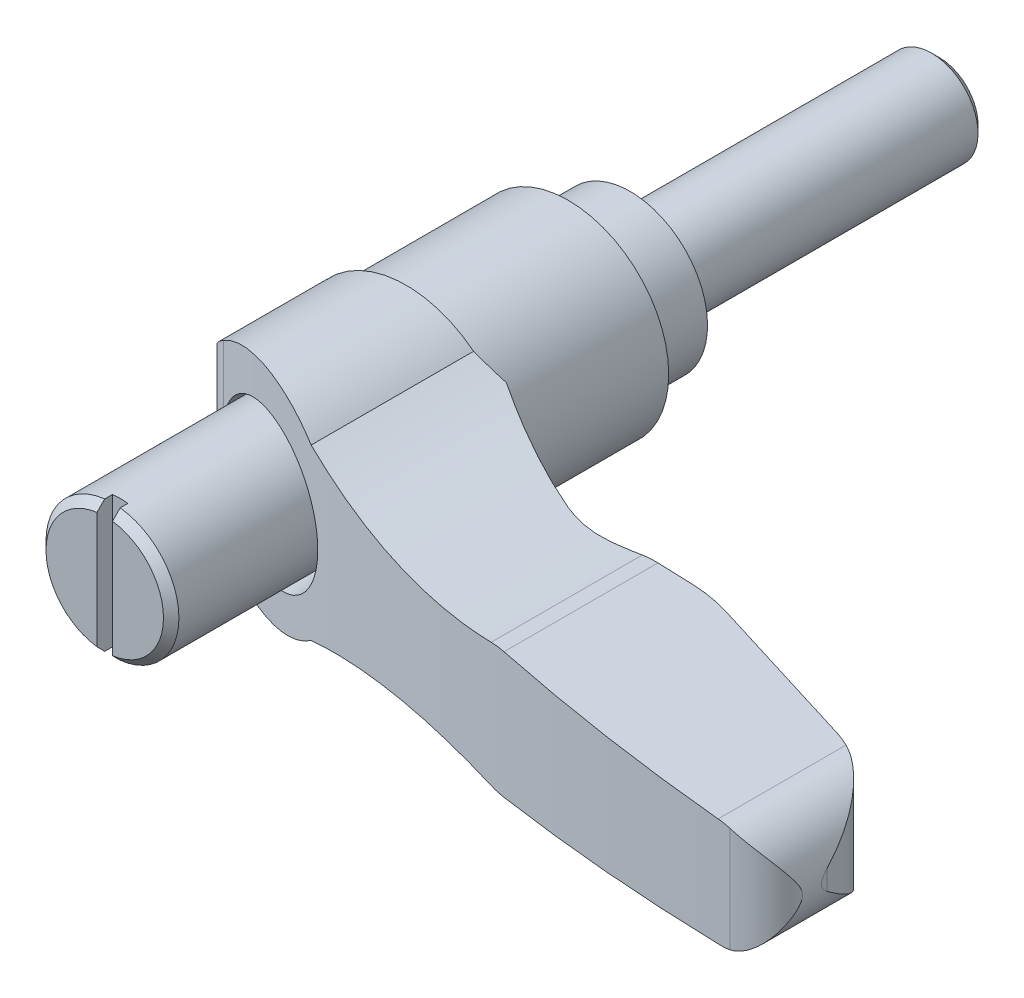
ISO-10303-21;
HEADER;
FILE_DESCRIPTION(('STEP AP214'),'2;1');
FILE_NAME('part.step','',(''),(''),'','','');
FILE_SCHEMA(('AUTOMOTIVE_DESIGN { 1 0 10303 214 1 1 1 1 }'));
ENDSEC;
DATA;
#1=APPLICATION_CONTEXT('core data for automotive mechanical design processes');
#2=APPLICATION_PROTOCOL_DEFINITION('international standard','automotive_design',2000,#1);
#3=PRODUCT_CONTEXT('',#1,'mechanical');
#4=PRODUCT('Part','Part','',(#3));
#5=PRODUCT_RELATED_PRODUCT_CATEGORY('part','',(#4));
#6=PRODUCT_DEFINITION_FORMATION('','',#4);
#7=PRODUCT_DEFINITION_CONTEXT('part definition',#1,'design');
#8=PRODUCT_DEFINITION('design','',#6,#7);
#9=PRODUCT_DEFINITION_SHAPE('','',#8);
#10=(LENGTH_UNIT() NAMED_UNIT(*) SI_UNIT(.MILLI.,.METRE.));
#11=(NAMED_UNIT(*) PLANE_ANGLE_UNIT() SI_UNIT($,.RADIAN.));
#12=(NAMED_UNIT(*) SI_UNIT($,.STERADIAN.) SOLID_ANGLE_UNIT());
#13=UNCERTAINTY_MEASURE_WITH_UNIT(LENGTH_MEASURE(1.E-05),#10,'distance_accuracy_value','');
#14=(GEOMETRIC_REPRESENTATION_CONTEXT(3) GLOBAL_UNCERTAINTY_ASSIGNED_CONTEXT((#13)) GLOBAL_UNIT_ASSIGNED_CONTEXT((#10,
#11,#12)) REPRESENTATION_CONTEXT('',''));
#15=CARTESIAN_POINT('',(0.,0.,0.));
#16=DIRECTION('',(0.,0.,1.));
#17=DIRECTION('',(1.,0.,0.));
#18=AXIS2_PLACEMENT_3D('',#15,#16,#17);
#19=CARTESIAN_POINT('',(0.,0.,-20.));
#20=DIRECTION('',(0.,0.,-1.));
#21=DIRECTION('',(0.,1.,0.));
#22=AXIS2_PLACEMENT_3D('',#19,#20,#21);
#23=PLANE('',#22);
#24=CARTESIAN_POINT('',(0.,0.,-20.));
#25=DIRECTION('',(0.,0.,-1.));
#26=DIRECTION('',(0.,1.,0.));
#27=AXIS2_PLACEMENT_3D('',#24,#25,#26);
#28=CIRCLE('',#27,2.5);
#29=CARTESIAN_POINT('',(0.,2.5,-20.));
#30=VERTEX_POINT('',#29);
#31=EDGE_CURVE('E289',#30,#30,#28,.T.);
#32=ORIENTED_EDGE('',*,*,#31,.T.);
#33=EDGE_LOOP('',(#32));
#34=FACE_BOUND('',#33,.T.);
#35=ADVANCED_FACE('F14',(#34),#23,.T.);
#36=CARTESIAN_POINT('',(0.,0.,-20.));
#37=DIRECTION('',(0.,0.,1.));
#38=DIRECTION('',(0.,-1.,0.));
#39=AXIS2_PLACEMENT_3D('',#36,#37,#38);
#40=CONICAL_SURFACE('',#39,2.5,0.785398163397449);
#41=CARTESIAN_POINT('',(0.,0.,-19.5));
#42=DIRECTION('',(0.,0.,-1.));
#43=DIRECTION('',(0.,1.,0.));
#44=AXIS2_PLACEMENT_3D('',#41,#42,#43);
#45=CIRCLE('',#44,3.);
#46=CARTESIAN_POINT('',(0.,3.,-19.5));
#47=VERTEX_POINT('',#46);
#48=EDGE_CURVE('E30',#47,#47,#45,.F.);
#49=ORIENTED_EDGE('',*,*,#48,.F.);
#50=EDGE_LOOP('',(#49));
#51=FACE_BOUND('',#50,.T.);
#52=ORIENTED_EDGE('',*,*,#31,.F.);
#53=EDGE_LOOP('',(#52));
#54=FACE_BOUND('',#53,.T.);
#55=ADVANCED_FACE('F525',(#51,#54),#40,.T.);
#56=CARTESIAN_POINT('',(0.,0.,-20.));
#57=DIRECTION('',(0.,0.,1.));
#58=DIRECTION('',(0.,-1.,0.));
#59=AXIS2_PLACEMENT_3D('',#56,#57,#58);
#60=CYLINDRICAL_SURFACE('',#59,3.);
#61=ORIENTED_EDGE('',*,*,#48,.T.);
#62=EDGE_LOOP('',(#61));
#63=FACE_BOUND('',#62,.T.);
#64=CARTESIAN_POINT('',(0.,0.,0.));
#65=DIRECTION('',(0.,0.,-1.));
#66=DIRECTION('',(0.,1.,0.));
#67=AXIS2_PLACEMENT_3D('',#64,#65,#66);
#68=CIRCLE('',#67,3.);
#69=CARTESIAN_POINT('',(0.,3.,0.));
#70=VERTEX_POINT('',#69);
#71=EDGE_CURVE('E543',#70,#70,#68,.T.);
#72=ORIENTED_EDGE('',*,*,#71,.T.);
#73=EDGE_LOOP('',(#72));
#74=FACE_BOUND('',#73,.T.);
#75=ADVANCED_FACE('F507',(#63,#74),#60,.T.);
#76=CARTESIAN_POINT('',(5.,0.,0.));
#77=DIRECTION('',(0.,0.,-1.));
#78=DIRECTION('',(0.,1.,0.));
#79=AXIS2_PLACEMENT_3D('',#76,#77,#78);
#80=PLANE('',#79);
#81=CARTESIAN_POINT('',(0.,0.,0.));
#82=DIRECTION('',(0.,0.,1.));
#83=DIRECTION('',(0.,-1.,0.));
#84=AXIS2_PLACEMENT_3D('',#81,#82,#83);
#85=CIRCLE('',#84,5.);
#86=CARTESIAN_POINT('',(0.,-5.,0.));
#87=VERTEX_POINT('',#86);
#88=EDGE_CURVE('E241',#87,#87,#85,.T.);
#89=ORIENTED_EDGE('',*,*,#88,.F.);
#90=EDGE_LOOP('',(#89));
#91=FACE_BOUND('',#90,.T.);
#92=ORIENTED_EDGE('',*,*,#71,.F.);
#93=EDGE_LOOP('',(#92));
#94=FACE_BOUND('',#93,.T.);
#95=ADVANCED_FACE('F501',(#91,#94),#80,.T.);
#96=CARTESIAN_POINT('',(0.,0.,4.));
#97=DIRECTION('',(0.,0.,1.));
#98=DIRECTION('',(0.,-1.,0.));
#99=AXIS2_PLACEMENT_3D('',#96,#97,#98);
#100=CYLINDRICAL_SURFACE('',#99,5.);
#101=ORIENTED_EDGE('',*,*,#88,.T.);
#102=EDGE_LOOP('',(#101));
#103=FACE_BOUND('',#102,.T.);
#104=CARTESIAN_POINT('',(0.,0.,4.55));
#105=DIRECTION('',(0.,0.,-1.));
#106=DIRECTION('',(1.,0.,0.));
#107=AXIS2_PLACEMENT_3D('',#104,#105,#106);
#108=CIRCLE('',#107,5.);
#109=CARTESIAN_POINT('',(5.,0.,4.55));
#110=VERTEX_POINT('',#109);
#111=EDGE_CURVE('E9',#110,#110,#108,.T.);
#112=ORIENTED_EDGE('',*,*,#111,.T.);
#113=EDGE_LOOP('',(#112));
#114=FACE_BOUND('',#113,.T.);
#115=ADVANCED_FACE('F493',(#103,#114),#100,.T.);
#116=CARTESIAN_POINT('',(0.,0.,34.));
#117=DIRECTION('',(0.,0.,-1.));
#118=DIRECTION('',(0.,1.,0.));
#119=AXIS2_PLACEMENT_3D('',#116,#117,#118);
#120=PLANE('',#119);
#121=CARTESIAN_POINT('',(0.,0.,34.));
#122=DIRECTION('',(0.,0.,-1.));
#123=DIRECTION('',(0.,1.,0.));
#124=AXIS2_PLACEMENT_3D('',#121,#122,#123);
#125=CIRCLE('',#124,3.8);
#126=CARTESIAN_POINT('',(0.5,-3.76696164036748,34.));
#127=VERTEX_POINT('',#126);
#128=CARTESIAN_POINT('',(0.5,3.76696164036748,34.));
#129=VERTEX_POINT('',#128);
#130=EDGE_CURVE('E244',#127,#129,#125,.F.);
#131=ORIENTED_EDGE('',*,*,#130,.T.);
#132=DIRECTION('',(0.,1.,0.));
#133=VECTOR('',#132,1.);
#134=CARTESIAN_POINT('',(0.5,5.,34.));
#135=LINE('',#134,#133);
#136=EDGE_CURVE('E547',#127,#129,#135,.T.);
#137=ORIENTED_EDGE('',*,*,#136,.F.);
#138=EDGE_LOOP('',(#131,#137));
#139=FACE_BOUND('',#138,.T.);
#140=ADVANCED_FACE('F490',(#139),#120,.F.);
#141=CARTESIAN_POINT('',(-0.5,3.76696164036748,34.));
#142=VERTEX_POINT('',#141);
#143=CARTESIAN_POINT('',(-0.5,-3.76696164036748,34.));
#144=VERTEX_POINT('',#143);
#145=EDGE_CURVE('E249',#142,#144,#125,.F.);
#146=ORIENTED_EDGE('',*,*,#145,.T.);
#147=DIRECTION('',(0.,-1.,0.));
#148=VECTOR('',#147,1.);
#149=CARTESIAN_POINT('',(-0.5,5.,34.));
#150=LINE('',#149,#148);
#151=EDGE_CURVE('E221',#142,#144,#150,.T.);
#152=ORIENTED_EDGE('',*,*,#151,.F.);
#153=EDGE_LOOP('',(#146,#152));
#154=FACE_BOUND('',#153,.T.);
#155=ADVANCED_FACE('F492',(#154),#120,.F.);
#156=CARTESIAN_POINT('',(0.,0.,33.5));
#157=DIRECTION('',(0.,0.,-1.));
#158=DIRECTION('',(0.,1.,0.));
#159=AXIS2_PLACEMENT_3D('',#156,#157,#158);
#160=CONICAL_SURFACE('',#159,4.3,0.785398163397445);
#161=CARTESIAN_POINT('',(-0.5,7.14579003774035,30.6367385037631));
#162=CARTESIAN_POINT('',(-0.5,6.87469589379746,30.907163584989));
#163=CARTESIAN_POINT('',(-0.5,6.60357153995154,31.1775584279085));
#164=CARTESIAN_POINT('',(-0.5,6.0612255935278,31.7182262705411));
#165=CARTESIAN_POINT('',(-0.5,5.79000400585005,31.9884992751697));
#166=CARTESIAN_POINT('',(-0.5,5.24743596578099,32.5288529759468));
#167=CARTESIAN_POINT('',(-0.5,4.97608953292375,32.7989336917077));
#168=CARTESIAN_POINT('',(-0.5,4.43313294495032,33.3388536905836));
#169=CARTESIAN_POINT('',(-0.5,4.16152277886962,33.6086929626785));
#170=CARTESIAN_POINT('',(-0.5,3.75373708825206,34.0131478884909));
#171=CARTESIAN_POINT('',(-0.5,3.61772939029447,34.1479327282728));
#172=CARTESIAN_POINT('',(-0.5,3.34555849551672,34.41734068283));
#173=CARTESIAN_POINT('',(-0.5,3.20939530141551,34.5519638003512));
#174=CARTESIAN_POINT('',(-0.5,2.93685991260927,34.8209619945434));
#175=CARTESIAN_POINT('',(-0.5,2.80048774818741,34.9553371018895));
#176=CARTESIAN_POINT('',(-0.5,2.52739320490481,35.2237482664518));
#177=CARTESIAN_POINT('',(-0.5,2.39067080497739,35.3577843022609));
#178=CARTESIAN_POINT('',(-0.5,2.18513448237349,35.5584388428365));
#179=CARTESIAN_POINT('',(-0.5,2.11653083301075,35.6252726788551));
#180=CARTESIAN_POINT('',(-0.5,1.97913719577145,35.7587462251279));
#181=CARTESIAN_POINT('',(-0.5,1.91034721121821,35.8253859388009));
#182=CARTESIAN_POINT('',(-0.5,1.77252789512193,35.9583896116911));
#183=CARTESIAN_POINT('',(-0.5,1.70349861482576,36.0247536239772));
#184=CARTESIAN_POINT('',(-0.5,1.56508132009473,36.1571160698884));
#185=CARTESIAN_POINT('',(-0.5,1.49569328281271,36.223114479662));
#186=CARTESIAN_POINT('',(-0.5,1.35634903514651,36.3546106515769));
#187=CARTESIAN_POINT('',(-0.5,1.28639245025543,36.4201080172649));
#188=CARTESIAN_POINT('',(-0.5,1.14569948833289,36.5502396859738));
#189=CARTESIAN_POINT('',(-0.5,1.07496325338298,36.6148741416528));
#190=CARTESIAN_POINT('',(-0.5,0.967839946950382,36.7107505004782));
#191=CARTESIAN_POINT('',(-0.5,0.931946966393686,36.7425432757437));
#192=CARTESIAN_POINT('',(-0.5,0.859716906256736,36.8056137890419));
#193=CARTESIAN_POINT('',(-0.5,0.823379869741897,36.8368915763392));
#194=CARTESIAN_POINT('',(-0.5,0.750082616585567,36.8987629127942));
#195=CARTESIAN_POINT('',(-0.5,0.713122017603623,36.9293560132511));
#196=CARTESIAN_POINT('',(-0.5,0.638313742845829,36.9894602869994));
#197=CARTESIAN_POINT('',(-0.5,0.600465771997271,37.0189710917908));
#198=CARTESIAN_POINT('',(-0.5,0.562043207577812,37.0477416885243));
#199=B_SPLINE_CURVE_WITH_KNOTS('',3,(#161,#162,#163,#164,#165,#166,#167,#168,#169,#170,#171,
#172,#173,#174,#175,#176,#177,#178,#179,#180,#181,#182,#183,#184,#185,#186,#187,#188,#189,#190,
#191,#192,#193,#194,#195,#196,#197,#198),.UNSPECIFIED.,.F.,.F.,(4,2,2,2,2,2,2,2,2,2,2,2,2,2,2,2,
2,2,4),(0.,1.14873667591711,2.29742189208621,3.44596538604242,4.59455887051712,5.1690023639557,
5.74343596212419,6.31779297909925,6.89218539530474,7.17951595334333,7.46684142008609,
7.75410874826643,8.04139460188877,8.32888815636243,8.61633015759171,8.76017280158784,
8.90400160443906,9.04792205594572,9.19189106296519),.UNSPECIFIED.);
#200=CARTESIAN_POINT('',(-0.5,4.27083130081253,33.5));
#201=VERTEX_POINT('',#200);
#202=EDGE_CURVE('E190',#201,#142,#199,.T.);
#203=ORIENTED_EDGE('',*,*,#202,.F.);
#204=CARTESIAN_POINT('',(0.,0.,33.5));
#205=DIRECTION('',(0.,0.,-1.));
#206=DIRECTION('',(0.,1.,0.));
#207=AXIS2_PLACEMENT_3D('',#204,#205,#206);
#208=CIRCLE('',#207,4.3);
#209=CARTESIAN_POINT('',(-0.5,-4.27083130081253,33.5));
#210=VERTEX_POINT('',#209);
#211=EDGE_CURVE('E234',#210,#201,#208,.T.);
#212=ORIENTED_EDGE('',*,*,#211,.F.);
#213=CARTESIAN_POINT('',(-0.5,-0.562043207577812,37.0477416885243));
#214=CARTESIAN_POINT('',(-0.5,-0.591562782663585,37.0256612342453));
#215=CARTESIAN_POINT('',(-0.5,-0.620732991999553,37.0031254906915));
#216=CARTESIAN_POINT('',(-0.5,-0.678508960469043,36.9573533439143));
#217=CARTESIAN_POINT('',(-0.5,-0.707114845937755,36.9341171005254));
#218=CARTESIAN_POINT('',(-0.5,-0.763893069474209,36.8871574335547));
#219=CARTESIAN_POINT('',(-0.5,-0.792065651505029,36.8634343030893));
#220=CARTESIAN_POINT('',(-0.5,-0.848085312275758,36.8156036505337));
#221=CARTESIAN_POINT('',(-0.5,-0.875932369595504,36.7914961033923));
#222=CARTESIAN_POINT('',(-0.5,-0.959051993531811,36.7187712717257));
#223=CARTESIAN_POINT('',(-0.5,-1.0139429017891,36.669718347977));
#224=CARTESIAN_POINT('',(-0.5,-1.12306845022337,36.5708712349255));
#225=CARTESIAN_POINT('',(-0.5,-1.17730296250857,36.5210769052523));
#226=CARTESIAN_POINT('',(-0.5,-1.34475427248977,36.3659472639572));
#227=CARTESIAN_POINT('',(-0.5,-1.4572060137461,36.2597875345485));
#228=CARTESIAN_POINT('',(-0.5,-1.68111383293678,36.0464226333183));
#229=CARTESIAN_POINT('',(-0.5,-1.79256987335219,35.9392174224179));
#230=CARTESIAN_POINT('',(-0.5,-2.01488759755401,35.7241936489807));
#231=CARTESIAN_POINT('',(-0.5,-2.12574928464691,35.6163750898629));
#232=CARTESIAN_POINT('',(-0.5,-2.34709619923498,35.4003567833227));
#233=CARTESIAN_POINT('',(-0.5,-2.45758143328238,35.2921570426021));
#234=CARTESIAN_POINT('',(-0.5,-2.78891994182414,34.9669349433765));
#235=CARTESIAN_POINT('',(-0.5,-3.00940313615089,34.7495356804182));
#236=CARTESIAN_POINT('',(-0.5,-3.44986918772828,34.3142422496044));
#237=CARTESIAN_POINT('',(-0.5,-3.66985205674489,34.096348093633));
#238=CARTESIAN_POINT('',(-0.5,-4.16175150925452,33.6084656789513));
#239=CARTESIAN_POINT('',(-0.5,-4.43359041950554,33.3383991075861));
#240=CARTESIAN_POINT('',(-0.5,-4.97701825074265,32.798009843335));
#241=CARTESIAN_POINT('',(-0.5,-5.24860716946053,32.5276871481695));
#242=CARTESIAN_POINT('',(-0.5,-5.79118913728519,31.9873183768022));
#243=CARTESIAN_POINT('',(-0.5,-6.06218244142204,31.7172725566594));
#244=CARTESIAN_POINT('',(-0.5,-6.60405724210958,31.1770740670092));
#245=CARTESIAN_POINT('',(-0.5,-6.87493873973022,30.9069213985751));
#246=CARTESIAN_POINT('',(-0.5,-7.14579003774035,30.6367385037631));
#247=B_SPLINE_CURVE_WITH_KNOTS('',3,(#213,#214,#215,#216,#217,#218,#219,#220,#221,#222,#223,
#224,#225,#226,#227,#228,#229,#230,#231,#232,#233,#234,#235,#236,#237,#238,#239,#240,#241,#242,
#243,#244,#245,#246),.UNSPECIFIED.,.F.,.F.,(4,2,2,2,2,2,2,2,2,2,2,2,2,2,2,2,4),(0.,
0.110577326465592,0.221129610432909,0.331617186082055,0.442111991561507,0.662945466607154,
0.883821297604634,1.34774036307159,1.81167683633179,2.27561072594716,2.7395364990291,
3.66844637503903,4.59733417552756,5.74689505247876,6.8964662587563,8.04418527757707,
9.19189304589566),.UNSPECIFIED.);
#248=EDGE_CURVE('E215',#144,#210,#247,.T.);
#249=ORIENTED_EDGE('',*,*,#248,.F.);
#250=ORIENTED_EDGE('',*,*,#145,.F.);
#251=EDGE_LOOP('',(#203,#212,#249,#250));
#252=FACE_BOUND('',#251,.T.);
#253=ADVANCED_FACE('F239',(#252),#160,.T.);
#254=CARTESIAN_POINT('',(0.5,0.562043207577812,37.0477416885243));
#255=CARTESIAN_POINT('',(0.5,0.591562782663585,37.0256612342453));
#256=CARTESIAN_POINT('',(0.5,0.620732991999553,37.0031254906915));
#257=CARTESIAN_POINT('',(0.5,0.678508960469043,36.9573533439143));
#258=CARTESIAN_POINT('',(0.5,0.707114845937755,36.9341171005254));
#259=CARTESIAN_POINT('',(0.5,0.763893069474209,36.8871574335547));
#260=CARTESIAN_POINT('',(0.5,0.792065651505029,36.8634343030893));
#261=CARTESIAN_POINT('',(0.5,0.848085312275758,36.8156036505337));
#262=CARTESIAN_POINT('',(0.5,0.875932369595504,36.7914961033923));
#263=CARTESIAN_POINT('',(0.5,0.959051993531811,36.7187712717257));
#264=CARTESIAN_POINT('',(0.5,1.0139429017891,36.669718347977));
#265=CARTESIAN_POINT('',(0.5,1.12306845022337,36.5708712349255));
#266=CARTESIAN_POINT('',(0.5,1.17730296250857,36.5210769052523));
#267=CARTESIAN_POINT('',(0.5,1.34475427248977,36.3659472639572));
#268=CARTESIAN_POINT('',(0.5,1.4572060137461,36.2597875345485));
#269=CARTESIAN_POINT('',(0.5,1.68111383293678,36.0464226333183));
#270=CARTESIAN_POINT('',(0.5,1.79256987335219,35.9392174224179));
#271=CARTESIAN_POINT('',(0.5,2.01488759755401,35.7241936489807));
#272=CARTESIAN_POINT('',(0.5,2.12574928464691,35.6163750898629));
#273=CARTESIAN_POINT('',(0.5,2.34709619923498,35.4003567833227));
#274=CARTESIAN_POINT('',(0.5,2.45758143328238,35.2921570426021));
#275=CARTESIAN_POINT('',(0.5,2.78891994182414,34.9669349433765));
#276=CARTESIAN_POINT('',(0.5,3.00940313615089,34.7495356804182));
#277=CARTESIAN_POINT('',(0.5,3.44986918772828,34.3142422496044));
#278=CARTESIAN_POINT('',(0.5,3.66985205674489,34.096348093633));
#279=CARTESIAN_POINT('',(0.5,4.16175150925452,33.6084656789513));
#280=CARTESIAN_POINT('',(0.5,4.43359041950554,33.3383991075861));
#281=CARTESIAN_POINT('',(0.5,4.97701825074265,32.798009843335));
#282=CARTESIAN_POINT('',(0.5,5.24860716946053,32.5276871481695));
#283=CARTESIAN_POINT('',(0.5,5.79118913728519,31.9873183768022));
#284=CARTESIAN_POINT('',(0.5,6.06218244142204,31.7172725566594));
#285=CARTESIAN_POINT('',(0.5,6.60405724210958,31.1770740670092));
#286=CARTESIAN_POINT('',(0.5,6.87493873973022,30.9069213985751));
#287=CARTESIAN_POINT('',(0.5,7.14579003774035,30.6367385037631));
#288=B_SPLINE_CURVE_WITH_KNOTS('',3,(#254,#255,#256,#257,#258,#259,#260,#261,#262,#263,#264,
#265,#266,#267,#268,#269,#270,#271,#272,#273,#274,#275,#276,#277,#278,#279,#280,#281,#282,#283,
#284,#285,#286,#287),.UNSPECIFIED.,.F.,.F.,(4,2,2,2,2,2,2,2,2,2,2,2,2,2,2,2,4),(0.,
0.110577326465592,0.221129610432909,0.331617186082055,0.442111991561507,0.662945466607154,
0.883821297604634,1.34774036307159,1.81167683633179,2.27561072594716,2.7395364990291,
3.66844637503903,4.59733417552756,5.74689505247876,6.8964662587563,8.04418527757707,
9.19189304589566),.UNSPECIFIED.);
#289=CARTESIAN_POINT('',(0.5,4.27083130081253,33.5));
#290=VERTEX_POINT('',#289);
#291=EDGE_CURVE('E226',#129,#290,#288,.T.);
#292=ORIENTED_EDGE('',*,*,#291,.F.);
#293=ORIENTED_EDGE('',*,*,#130,.F.);
#294=CARTESIAN_POINT('',(0.5,-7.14579003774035,30.6367385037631));
#295=CARTESIAN_POINT('',(0.5,-6.87469589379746,30.907163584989));
#296=CARTESIAN_POINT('',(0.5,-6.60357153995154,31.1775584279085));
#297=CARTESIAN_POINT('',(0.5,-6.0612255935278,31.7182262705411));
#298=CARTESIAN_POINT('',(0.5,-5.79000400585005,31.9884992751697));
#299=CARTESIAN_POINT('',(0.5,-5.24743596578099,32.5288529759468));
#300=CARTESIAN_POINT('',(0.5,-4.97608953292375,32.7989336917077));
#301=CARTESIAN_POINT('',(0.5,-4.43313294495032,33.3388536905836));
#302=CARTESIAN_POINT('',(0.5,-4.16152277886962,33.6086929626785));
#303=CARTESIAN_POINT('',(0.5,-3.75373708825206,34.0131478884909));
#304=CARTESIAN_POINT('',(0.5,-3.61772939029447,34.1479327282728));
#305=CARTESIAN_POINT('',(0.5,-3.34555849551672,34.41734068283));
#306=CARTESIAN_POINT('',(0.5,-3.20939530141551,34.5519638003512));
#307=CARTESIAN_POINT('',(0.5,-2.93685991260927,34.8209619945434));
#308=CARTESIAN_POINT('',(0.5,-2.80048774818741,34.9553371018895));
#309=CARTESIAN_POINT('',(0.5,-2.52739320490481,35.2237482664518));
#310=CARTESIAN_POINT('',(0.5,-2.39067080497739,35.3577843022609));
#311=CARTESIAN_POINT('',(0.5,-2.18513448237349,35.5584388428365));
#312=CARTESIAN_POINT('',(0.5,-2.11653083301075,35.6252726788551));
#313=CARTESIAN_POINT('',(0.5,-1.97913719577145,35.7587462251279));
#314=CARTESIAN_POINT('',(0.5,-1.91034721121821,35.8253859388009));
#315=CARTESIAN_POINT('',(0.5,-1.77252789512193,35.9583896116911));
#316=CARTESIAN_POINT('',(0.5,-1.70349861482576,36.0247536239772));
#317=CARTESIAN_POINT('',(0.5,-1.56508132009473,36.1571160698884));
#318=CARTESIAN_POINT('',(0.5,-1.49569328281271,36.223114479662));
#319=CARTESIAN_POINT('',(0.5,-1.35634903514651,36.3546106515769));
#320=CARTESIAN_POINT('',(0.5,-1.28639245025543,36.4201080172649));
#321=CARTESIAN_POINT('',(0.5,-1.14569948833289,36.5502396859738));
#322=CARTESIAN_POINT('',(0.5,-1.07496325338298,36.6148741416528));
#323=CARTESIAN_POINT('',(0.5,-0.967839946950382,36.7107505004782));
#324=CARTESIAN_POINT('',(0.5,-0.931946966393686,36.7425432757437));
#325=CARTESIAN_POINT('',(0.5,-0.859716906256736,36.8056137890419));
#326=CARTESIAN_POINT('',(0.5,-0.823379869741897,36.8368915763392));
#327=CARTESIAN_POINT('',(0.5,-0.750082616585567,36.8987629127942));
#328=CARTESIAN_POINT('',(0.5,-0.713122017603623,36.9293560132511));
#329=CARTESIAN_POINT('',(0.5,-0.638313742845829,36.9894602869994));
#330=CARTESIAN_POINT('',(0.5,-0.600465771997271,37.0189710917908));
#331=CARTESIAN_POINT('',(0.5,-0.562043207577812,37.0477416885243));
#332=B_SPLINE_CURVE_WITH_KNOTS('',3,(#294,#295,#296,#297,#298,#299,#300,#301,#302,#303,#304,
#305,#306,#307,#308,#309,#310,#311,#312,#313,#314,#315,#316,#317,#318,#319,#320,#321,#322,#323,
#324,#325,#326,#327,#328,#329,#330,#331),.UNSPECIFIED.,.F.,.F.,(4,2,2,2,2,2,2,2,2,2,2,2,2,2,2,2,
2,2,4),(0.,1.14873667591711,2.29742189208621,3.44596538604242,4.59455887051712,5.1690023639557,
5.74343596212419,6.31779297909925,6.89218539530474,7.17951595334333,7.46684142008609,
7.75410874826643,8.04139460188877,8.32888815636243,8.61633015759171,8.76017280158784,
8.90400160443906,9.04792205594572,9.19189106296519),.UNSPECIFIED.);
#333=CARTESIAN_POINT('',(0.5,-4.27083130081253,33.5));
#334=VERTEX_POINT('',#333);
#335=EDGE_CURVE('E251',#334,#127,#332,.T.);
#336=ORIENTED_EDGE('',*,*,#335,.F.);
#337=EDGE_CURVE('E240',#290,#334,#208,.T.);
#338=ORIENTED_EDGE('',*,*,#337,.F.);
#339=EDGE_LOOP('',(#292,#293,#336,#338));
#340=FACE_BOUND('',#339,.T.);
#341=ADVANCED_FACE('F263',(#340),#160,.T.);
#342=CARTESIAN_POINT('',(0.5,5.,33.));
#343=DIRECTION('',(1.,0.,0.));
#344=DIRECTION('',(0.,1.,0.));
#345=AXIS2_PLACEMENT_3D('',#342,#343,#344);
#346=PLANE('',#345);
#347=DIRECTION('',(0.,0.,1.));
#348=VECTOR('',#347,1.);
#349=CARTESIAN_POINT('',(0.5,4.27083130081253,4.));
#350=LINE('',#349,#348);
#351=CARTESIAN_POINT('',(0.5,4.27083130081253,33.));
#352=VERTEX_POINT('',#351);
#353=EDGE_CURVE('E237',#290,#352,#350,.F.);
#354=ORIENTED_EDGE('',*,*,#353,.T.);
#355=DIRECTION('',(0.,1.,0.));
#356=VECTOR('',#355,1.);
#357=CARTESIAN_POINT('',(0.5,5.,33.));
#358=LINE('',#357,#356);
#359=CARTESIAN_POINT('',(0.5,-4.27083130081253,33.));
#360=VERTEX_POINT('',#359);
#361=EDGE_CURVE('E555',#360,#352,#358,.T.);
#362=ORIENTED_EDGE('',*,*,#361,.F.);
#363=DIRECTION('',(0.,0.,1.));
#364=VECTOR('',#363,1.);
#365=CARTESIAN_POINT('',(0.5,-4.27083130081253,4.));
#366=LINE('',#365,#364);
#367=EDGE_CURVE('E39',#360,#334,#366,.T.);
#368=ORIENTED_EDGE('',*,*,#367,.T.);
#369=ORIENTED_EDGE('',*,*,#335,.T.);
#370=ORIENTED_EDGE('',*,*,#136,.T.);
#371=ORIENTED_EDGE('',*,*,#291,.T.);
#372=EDGE_LOOP('',(#354,#362,#368,#369,#370,#371));
#373=FACE_BOUND('',#372,.T.);
#374=ADVANCED_FACE('F267',(#373),#346,.F.);
#375=CARTESIAN_POINT('',(-0.5,-5.,33.));
#376=DIRECTION('',(0.,0.,1.));
#377=DIRECTION('',(0.,-1.,0.));
#378=AXIS2_PLACEMENT_3D('',#375,#376,#377);
#379=PLANE('',#378);
#380=DIRECTION('',(0.,-1.,0.));
#381=VECTOR('',#380,1.);
#382=CARTESIAN_POINT('',(-0.5,5.,33.));
#383=LINE('',#382,#381);
#384=CARTESIAN_POINT('',(-0.5,4.27083130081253,33.));
#385=VERTEX_POINT('',#384);
#386=CARTESIAN_POINT('',(-0.5,-4.27083130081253,33.));
#387=VERTEX_POINT('',#386);
#388=EDGE_CURVE('E553',#385,#387,#383,.T.);
#389=ORIENTED_EDGE('',*,*,#388,.T.);
#390=CARTESIAN_POINT('',(0.,0.,33.));
#391=DIRECTION('',(0.,0.,1.));
#392=DIRECTION('',(0.,-1.,0.));
#393=AXIS2_PLACEMENT_3D('',#390,#391,#392);
#394=CIRCLE('',#393,4.3);
#395=EDGE_CURVE('E235',#360,#387,#394,.F.);
#396=ORIENTED_EDGE('',*,*,#395,.F.);
#397=ORIENTED_EDGE('',*,*,#361,.T.);
#398=EDGE_CURVE('E288',#385,#352,#394,.F.);
#399=ORIENTED_EDGE('',*,*,#398,.F.);
#400=EDGE_LOOP('',(#389,#396,#397,#399));
#401=FACE_BOUND('',#400,.T.);
#402=ADVANCED_FACE('F271',(#401),#379,.T.);
#403=CARTESIAN_POINT('',(-0.5,5.,33.));
#404=DIRECTION('',(-1.,0.,0.));
#405=DIRECTION('',(0.,-1.,0.));
#406=AXIS2_PLACEMENT_3D('',#403,#404,#405);
#407=PLANE('',#406);
#408=DIRECTION('',(0.,0.,1.));
#409=VECTOR('',#408,1.);
#410=CARTESIAN_POINT('',(-0.5,4.27083130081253,4.));
#411=LINE('',#410,#409);
#412=EDGE_CURVE('E236',#385,#201,#411,.T.);
#413=ORIENTED_EDGE('',*,*,#412,.T.);
#414=ORIENTED_EDGE('',*,*,#202,.T.);
#415=ORIENTED_EDGE('',*,*,#151,.T.);
#416=ORIENTED_EDGE('',*,*,#248,.T.);
#417=DIRECTION('',(0.,0.,1.));
#418=VECTOR('',#417,1.);
#419=CARTESIAN_POINT('',(-0.5,-4.27083130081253,4.));
#420=LINE('',#419,#418);
#421=EDGE_CURVE('E219',#210,#387,#420,.F.);
#422=ORIENTED_EDGE('',*,*,#421,.T.);
#423=ORIENTED_EDGE('',*,*,#388,.F.);
#424=EDGE_LOOP('',(#413,#414,#415,#416,#422,#423));
#425=FACE_BOUND('',#424,.T.);
#426=ADVANCED_FACE('F217',(#425),#407,.F.);
#427=CARTESIAN_POINT('',(0.,0.,4.));
#428=DIRECTION('',(0.,0.,1.));
#429=DIRECTION('',(0.,-1.,0.));
#430=AXIS2_PLACEMENT_3D('',#427,#428,#429);
#431=CYLINDRICAL_SURFACE('',#430,4.3);
#432=ORIENTED_EDGE('',*,*,#412,.F.);
#433=ORIENTED_EDGE('',*,*,#398,.T.);
#434=ORIENTED_EDGE('',*,*,#353,.F.);
#435=ORIENTED_EDGE('',*,*,#337,.T.);
#436=ORIENTED_EDGE('',*,*,#367,.F.);
#437=ORIENTED_EDGE('',*,*,#395,.T.);
#438=ORIENTED_EDGE('',*,*,#421,.F.);
#439=ORIENTED_EDGE('',*,*,#211,.T.);
#440=EDGE_LOOP('',(#432,#433,#434,#435,#436,#437,#438,#439));
#441=FACE_BOUND('',#440,.T.);
#442=CARTESIAN_POINT('',(0.,0.,21.34));
#443=DIRECTION('',(0.,0.,-1.));
#444=DIRECTION('',(0.,1.,0.));
#445=AXIS2_PLACEMENT_3D('',#442,#443,#444);
#446=CIRCLE('',#445,4.3);
#447=CARTESIAN_POINT('',(0.,4.3,21.34));
#448=VERTEX_POINT('',#447);
#449=EDGE_CURVE('E545',#448,#448,#446,.F.);
#450=ORIENTED_EDGE('',*,*,#449,.T.);
#451=EDGE_LOOP('',(#450));
#452=FACE_BOUND('',#451,.T.);
#453=ADVANCED_FACE('F232',(#441,#452),#431,.T.);
#454=CARTESIAN_POINT('',(-0.009999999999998,0.,16.5625));
#455=DIRECTION('',(0.,0.,-1.));
#456=DIRECTION('',(1.,0.,0.));
#457=AXIS2_PLACEMENT_3D('',#454,#455,#456);
#458=CYLINDRICAL_SURFACE('',#457,6.5);
#459=CARTESIAN_POINT('',(-0.0099999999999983,0.,14.5));
#460=DIRECTION('',(0.,0.,1.));
#461=DIRECTION('',(0.,-1.,0.));
#462=AXIS2_PLACEMENT_3D('',#459,#460,#461);
#463=CIRCLE('',#462,6.5);
#464=CARTESIAN_POINT('',(-6.51,0.,14.5));
#465=VERTEX_POINT('',#464);
#466=CARTESIAN_POINT('',(6.49,0.,14.5));
#467=VERTEX_POINT('',#466);
#468=EDGE_CURVE('E1166',#465,#467,#463,.T.);
#469=ORIENTED_EDGE('',*,*,#468,.F.);
#470=EDGE_CURVE('E1055',#467,#465,#463,.T.);
#471=ORIENTED_EDGE('',*,*,#470,.F.);
#472=EDGE_LOOP('',(#469,#471));
#473=FACE_BOUND('',#472,.T.);
#474=CARTESIAN_POINT('',(-0.0100000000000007,0.,-2.35002265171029));
#475=DIRECTION('',(0.707106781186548,0.,0.707106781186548));
#476=DIRECTION('',(0.707106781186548,0.,-0.707106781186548));
#477=AXIS2_PLACEMENT_3D('',#474,#475,#476);
#478=ELLIPSE('',#477,9.19238815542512,6.5);
#479=CARTESIAN_POINT('',(-6.3600226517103,-1.38824072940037,4.));
#480=VERTEX_POINT('',#479);
#481=CARTESIAN_POINT('',(-6.3600226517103,1.38824072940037,4.));
#482=VERTEX_POINT('',#481);
#483=EDGE_CURVE('E1163',#480,#482,#478,.F.);
#484=ORIENTED_EDGE('',*,*,#483,.F.);
#485=CARTESIAN_POINT('',(-0.0099999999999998,0.,4.));
#486=DIRECTION('',(0.,0.,-1.));
#487=DIRECTION('',(1.,0.,0.));
#488=AXIS2_PLACEMENT_3D('',#485,#486,#487);
#489=CIRCLE('',#488,6.5);
#490=EDGE_CURVE('E176',#482,#480,#489,.T.);
#491=ORIENTED_EDGE('',*,*,#490,.F.);
#492=EDGE_LOOP('',(#484,#491));
#493=FACE_BOUND('',#492,.T.);
#494=ADVANCED_FACE('F322',(#473,#493),#458,.T.);
#495=CARTESIAN_POINT('',(-6.51,-14.,4.1499773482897));
#496=DIRECTION('',(0.707106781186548,0.,0.707106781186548));
#497=DIRECTION('',(-0.707106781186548,0.,0.707106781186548));
#498=AXIS2_PLACEMENT_3D('',#495,#496,#497);
#499=PLANE('',#498);
#500=ORIENTED_EDGE('',*,*,#483,.T.);
#501=DIRECTION('',(0.,1.,0.));
#502=VECTOR('',#501,1.);
#503=CARTESIAN_POINT('',(-6.3600226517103,-14.,4.));
#504=LINE('',#503,#502);
#505=EDGE_CURVE('E303',#480,#482,#504,.T.);
#506=ORIENTED_EDGE('',*,*,#505,.F.);
#507=EDGE_LOOP('',(#500,#506));
#508=FACE_BOUND('',#507,.T.);
#509=ADVANCED_FACE('F316',(#508),#499,.F.);
#510=CARTESIAN_POINT('',(-0.0099999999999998,0.,4.));
#511=DIRECTION('',(0.,0.,-1.));
#512=DIRECTION('',(1.,0.,0.));
#513=AXIS2_PLACEMENT_3D('',#510,#511,#512);
#514=PLANE('',#513);
#515=CARTESIAN_POINT('',(0.,0.,4.));
#516=DIRECTION('',(0.,0.,-1.));
#517=DIRECTION('',(1.,0.,0.));
#518=AXIS2_PLACEMENT_3D('',#515,#516,#517);
#519=CIRCLE('',#518,5.25);
#520=CARTESIAN_POINT('',(5.25,0.,4.));
#521=VERTEX_POINT('',#520);
#522=EDGE_CURVE('E1037',#521,#521,#519,.T.);
#523=ORIENTED_EDGE('',*,*,#522,.F.);
#524=EDGE_LOOP('',(#523));
#525=FACE_BOUND('',#524,.T.);
#526=ORIENTED_EDGE('',*,*,#505,.T.);
#527=ORIENTED_EDGE('',*,*,#490,.T.);
#528=EDGE_LOOP('',(#526,#527));
#529=FACE_BOUND('',#528,.T.);
#530=ADVANCED_FACE('F321',(#525,#529),#514,.T.);
#531=CARTESIAN_POINT('',(0.,0.,4.));
#532=DIRECTION('',(0.,0.,1.));
#533=DIRECTION('',(0.,-1.,0.));
#534=AXIS2_PLACEMENT_3D('',#531,#532,#533);
#535=CYLINDRICAL_SURFACE('',#534,5.25);
#536=ORIENTED_EDGE('',*,*,#522,.T.);
#537=EDGE_LOOP('',(#536));
#538=FACE_BOUND('',#537,.T.);
#539=CARTESIAN_POINT('',(0.,0.,4.3));
#540=DIRECTION('',(0.,0.,1.));
#541=DIRECTION('',(0.,-1.,0.));
#542=AXIS2_PLACEMENT_3D('',#539,#540,#541);
#543=CIRCLE('',#542,5.25);
#544=CARTESIAN_POINT('',(0.,-5.25,4.3));
#545=VERTEX_POINT('',#544);
#546=EDGE_CURVE('E294',#545,#545,#543,.T.);
#547=ORIENTED_EDGE('',*,*,#546,.T.);
#548=EDGE_LOOP('',(#547));
#549=FACE_BOUND('',#548,.T.);
#550=ADVANCED_FACE('F511',(#538,#549),#535,.F.);
#551=CARTESIAN_POINT('',(0.,0.,4.55));
#552=DIRECTION('',(0.,0.,-1.));
#553=DIRECTION('',(0.,1.,0.));
#554=AXIS2_PLACEMENT_3D('',#551,#552,#553);
#555=CONICAL_SURFACE('',#554,5.,0.785398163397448);
#556=ORIENTED_EDGE('',*,*,#546,.F.);
#557=EDGE_LOOP('',(#556));
#558=FACE_BOUND('',#557,.T.);
#559=ORIENTED_EDGE('',*,*,#111,.F.);
#560=EDGE_LOOP('',(#559));
#561=FACE_BOUND('',#560,.T.);
#562=ADVANCED_FACE('F315',(#558,#561),#555,.F.);
#563=CARTESIAN_POINT('',(39.938965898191,-8.,27.204249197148));
#564=DIRECTION('',(-0.989626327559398,0.,0.143665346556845));
#565=DIRECTION('',(-0.143665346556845,0.,-0.989626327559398));
#566=AXIS2_PLACEMENT_3D('',#563,#564,#565);
#567=PLANE('',#566);
#568=CARTESIAN_POINT('',(36.5,0.,3.51522972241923));
#569=DIRECTION('',(-0.989626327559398,0.,0.143665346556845));
#570=DIRECTION('',(0.143665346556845,0.,0.989626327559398));
#571=AXIS2_PLACEMENT_3D('',#568,#569,#570);
#572=ELLIPSE('',#571,24.3621728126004,3.5);
#573=CARTESIAN_POINT('',(39.938965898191,-0.650779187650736,27.204249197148));
#574=VERTEX_POINT('',#573);
#575=CARTESIAN_POINT('',(39.938965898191,0.650779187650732,27.204249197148));
#576=VERTEX_POINT('',#575);
#577=EDGE_CURVE('E463',#574,#576,#572,.T.);
#578=ORIENTED_EDGE('',*,*,#577,.F.);
#579=DIRECTION('',(0.,1.,0.));
#580=VECTOR('',#579,1.);
#581=CARTESIAN_POINT('',(39.938965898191,-8.,27.204249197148));
#582=LINE('',#581,#580);
#583=EDGE_CURVE('E1061',#574,#576,#582,.T.);
#584=ORIENTED_EDGE('',*,*,#583,.T.);
#585=EDGE_LOOP('',(#578,#584));
#586=FACE_BOUND('',#585,.T.);
#587=ADVANCED_FACE('F475',(#586),#567,.F.);
#588=CARTESIAN_POINT('',(33.8626602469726,-8.,28.0863544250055));
#589=DIRECTION('',(0.,1.,0.));
#590=DIRECTION('',(-1.,0.,0.));
#591=AXIS2_PLACEMENT_3D('',#588,#589,#590);
#592=CYLINDRICAL_SURFACE('',#591,6.14000000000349);
#593=CARTESIAN_POINT('',(33.8626602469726,3.59762871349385,28.0863544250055));
#594=DIRECTION('',(0.0369925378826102,0.999315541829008,0.));
#595=DIRECTION('',(-0.999315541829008,0.0369925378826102,0.));
#596=AXIS2_PLACEMENT_3D('',#593,#594,#595);
#597=ELLIPSE('',#596,6.14420545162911,6.14000000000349);
#598=CARTESIAN_POINT('',(36.5,3.5,22.5416236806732));
#599=VERTEX_POINT('',#598);
#600=CARTESIAN_POINT('',(35.534460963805,3.53574220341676,22.178335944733));
#601=VERTEX_POINT('',#600);
#602=EDGE_CURVE('E1091',#599,#601,#597,.T.);
#603=ORIENTED_EDGE('',*,*,#602,.F.);
#604=CARTESIAN_POINT('',(39.938965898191,0.650779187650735,27.204249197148));
#605=CARTESIAN_POINT('',(39.9247028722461,0.726086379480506,27.1059853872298));
#606=CARTESIAN_POINT('',(39.9079968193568,0.800887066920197,27.007686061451));
#607=CARTESIAN_POINT('',(39.8696347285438,0.949458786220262,26.8112602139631));
#608=CARTESIAN_POINT('',(39.8479781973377,1.02322971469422,26.7131337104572));
#609=CARTESIAN_POINT('',(39.7995979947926,1.16988012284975,26.5170899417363));
#610=CARTESIAN_POINT('',(39.7728626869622,1.24275713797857,26.4191736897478));
#611=CARTESIAN_POINT('',(39.7142815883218,1.38725410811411,26.2239599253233));
#612=CARTESIAN_POINT('',(39.6824358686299,1.45887408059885,26.1266624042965));
#613=CARTESIAN_POINT('',(39.5782917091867,1.67318502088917,25.8337016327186));
#614=CARTESIAN_POINT('',(39.4979263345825,1.81366367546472,25.6391889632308));
#615=CARTESIAN_POINT('',(39.3150854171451,2.08619457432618,25.2551202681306));
#616=CARTESIAN_POINT('',(39.2126344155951,2.21825596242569,25.0655590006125));
#617=CARTESIAN_POINT('',(38.9595027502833,2.49877334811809,24.6523338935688));
#618=CARTESIAN_POINT('',(38.8031801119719,2.64456339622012,24.4302018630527));
#619=CARTESIAN_POINT('',(38.5417124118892,2.84488994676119,24.108275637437));
#620=CARTESIAN_POINT('',(38.4501831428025,2.90854134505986,24.0029632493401));
#621=CARTESIAN_POINT('',(38.2579442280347,3.02861213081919,23.7967186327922));
#622=CARTESIAN_POINT('',(38.1572360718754,3.08503268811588,23.6957856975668));
#623=CARTESIAN_POINT('',(37.8892625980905,3.21757634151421,23.4457323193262));
#624=CARTESIAN_POINT('',(37.7155213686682,3.28779061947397,23.3001643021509));
#625=CARTESIAN_POINT('',(37.4396992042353,3.37286339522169,23.0946053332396));
#626=CARTESIAN_POINT('',(37.3453175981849,3.39783246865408,23.0282732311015));
#627=CARTESIAN_POINT('',(37.1517842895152,3.44019984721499,22.9003457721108));
#628=CARTESIAN_POINT('',(37.0526354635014,3.45760265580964,22.8387476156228));
#629=CARTESIAN_POINT('',(36.8781783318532,3.48029211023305,22.7372021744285));
#630=CARTESIAN_POINT('',(36.8038676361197,3.48759914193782,22.6959814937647));
#631=CARTESIAN_POINT('',(36.6533047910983,3.49745586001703,22.6165121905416));
#632=CARTESIAN_POINT('',(36.5770513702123,3.50000234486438,22.57826558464));
#633=CARTESIAN_POINT('',(36.5,3.5,22.5416236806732));
#634=B_SPLINE_CURVE_WITH_KNOTS('',3,(#604,#605,#606,#607,#608,#609,#610,#611,#612,#613,#614,
#615,#616,#617,#618,#619,#620,#621,#622,#623,#624,#625,#626,#627,#628,#629,#630,#631,#632,#633),
.UNSPECIFIED.,.F.,.F.,(4,2,2,2,2,2,2,2,2,2,2,2,2,2,4),(0.,0.373839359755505,0.747715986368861,
1.1224598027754,1.49719840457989,2.25512351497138,3.01221072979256,3.93367725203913,
4.39332639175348,4.85290107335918,5.56171222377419,5.91546495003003,6.26900683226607,
6.52468766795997,6.78054039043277),.UNSPECIFIED.);
#635=EDGE_CURVE('E462',#576,#599,#634,.T.);
#636=ORIENTED_EDGE('',*,*,#635,.F.);
#637=ORIENTED_EDGE('',*,*,#583,.F.);
#638=CARTESIAN_POINT('',(36.5,-3.5,22.5416236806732));
#639=CARTESIAN_POINT('',(36.6061539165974,-3.50000941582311,22.5920863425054));
#640=CARTESIAN_POINT('',(36.7107657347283,-3.49517280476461,22.6456099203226));
#641=CARTESIAN_POINT('',(36.9160027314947,-3.47671082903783,22.7581011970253));
#642=CARTESIAN_POINT('',(37.016634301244,-3.46310021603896,22.8170596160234));
#643=CARTESIAN_POINT('',(37.212347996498,-3.42816986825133,22.9392782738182));
#644=CARTESIAN_POINT('',(37.3074768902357,-3.40693163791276,23.0024874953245));
#645=CARTESIAN_POINT('',(37.4929223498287,-3.35757592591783,23.1332068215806));
#646=CARTESIAN_POINT('',(37.5832363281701,-3.32945478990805,23.2007191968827));
#647=CARTESIAN_POINT('',(37.7830795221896,-3.2585052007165,23.3587409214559));
#648=CARTESIAN_POINT('',(37.8909927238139,-3.21376078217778,23.4504360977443));
#649=CARTESIAN_POINT('',(38.0982482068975,-3.11588681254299,23.6389903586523));
#650=CARTESIAN_POINT('',(38.1975840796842,-3.06275107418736,23.7358532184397));
#651=CARTESIAN_POINT('',(38.3880468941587,-2.94917464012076,23.934309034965));
#652=CARTESIAN_POINT('',(38.4791322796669,-2.88870020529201,24.035922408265));
#653=CARTESIAN_POINT('',(38.6526412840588,-2.761826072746,24.2426721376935));
#654=CARTESIAN_POINT('',(38.7350674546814,-2.69542813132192,24.3478074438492));
#655=CARTESIAN_POINT('',(38.9229341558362,-2.52996933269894,24.6038856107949));
#656=CARTESIAN_POINT('',(39.0243159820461,-2.42850340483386,24.7562617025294));
#657=CARTESIAN_POINT('',(39.2111706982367,-2.21796613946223,25.0654781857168));
#658=CARTESIAN_POINT('',(39.2966363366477,-2.10889136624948,25.2223205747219));
#659=CARTESIAN_POINT('',(39.4522229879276,-1.88493092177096,25.5392893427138));
#660=CARTESIAN_POINT('',(39.5223498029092,-1.77004746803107,25.6994144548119));
#661=CARTESIAN_POINT('',(39.6478320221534,-1.53583460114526,26.0220530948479));
#662=CARTESIAN_POINT('',(39.7031929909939,-1.41650688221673,26.1845656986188));
#663=CARTESIAN_POINT('',(39.7933776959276,-1.19018579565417,26.4900634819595));
#664=CARTESIAN_POINT('',(39.8299343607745,-1.08360162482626,26.6328455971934));
#665=CARTESIAN_POINT('',(39.8923391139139,-0.86858691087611,26.9185049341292));
#666=CARTESIAN_POINT('',(39.9182264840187,-0.760164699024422,27.0613798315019));
#667=CARTESIAN_POINT('',(39.938965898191,-0.650779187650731,27.204249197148));
#668=B_SPLINE_CURVE_WITH_KNOTS('',3,(#638,#639,#640,#641,#642,#643,#644,#645,#646,#647,#648,
#649,#650,#651,#652,#653,#654,#655,#656,#657,#658,#659,#660,#661,#662,#663,#664,#665,#666,#667),
.UNSPECIFIED.,.F.,.F.,(4,2,2,2,2,2,2,2,2,2,2,2,2,2,4),(0.,0.352350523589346,0.704110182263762,
1.05221781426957,1.40051067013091,1.84538152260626,2.29058194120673,2.73791274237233,
3.18511134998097,3.81198117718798,4.43913591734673,5.06605301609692,5.69273352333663,
6.23807905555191,6.78139842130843),.UNSPECIFIED.);
#669=CARTESIAN_POINT('',(36.5,-3.5,22.5416236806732));
#670=VERTEX_POINT('',#669);
#671=EDGE_CURVE('E456',#670,#574,#668,.T.);
#672=ORIENTED_EDGE('',*,*,#671,.F.);
#673=CARTESIAN_POINT('',(33.8626602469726,-3.59762871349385,28.0863544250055));
#674=DIRECTION('',(0.0369925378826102,-0.999315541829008,0.));
#675=DIRECTION('',(0.999315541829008,0.0369925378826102,0.));
#676=AXIS2_PLACEMENT_3D('',#673,#674,#675);
#677=ELLIPSE('',#676,6.14420545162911,6.14000000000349);
#678=CARTESIAN_POINT('',(35.534460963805,-3.53574220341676,22.178335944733));
#679=VERTEX_POINT('',#678);
#680=EDGE_CURVE('E1104',#679,#670,#677,.T.);
#681=ORIENTED_EDGE('',*,*,#680,.F.);
#682=DIRECTION('',(0.,1.,0.));
#683=VECTOR('',#682,1.);
#684=CARTESIAN_POINT('',(35.534460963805,-8.,22.178335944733));
#685=LINE('',#684,#683);
#686=EDGE_CURVE('E1064',#679,#601,#685,.T.);
#687=ORIENTED_EDGE('',*,*,#686,.T.);
#688=EDGE_LOOP('',(#603,#636,#637,#672,#681,#687));
#689=FACE_BOUND('',#688,.T.);
#690=ADVANCED_FACE('F469',(#689),#592,.T.);
#691=CARTESIAN_POINT('',(25.51080482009,-8.,19.34192715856));
#692=DIRECTION('',(-0.272280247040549,0.,0.962217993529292));
#693=DIRECTION('',(-0.962217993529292,0.,-0.272280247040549));
#694=AXIS2_PLACEMENT_3D('',#691,#692,#693);
#695=PLANE('',#694);
#696=DIRECTION('',(-0.961608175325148,0.0355966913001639,-0.272107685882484));
#697=VECTOR('',#696,1.);
#698=CARTESIAN_POINT('',(25.918375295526,3.8917092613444,19.457257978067));
#699=LINE('',#698,#697);
#700=CARTESIAN_POINT('',(25.51080482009,3.90679665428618,19.34192715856));
#701=VERTEX_POINT('',#700);
#702=EDGE_CURVE('E1090',#601,#701,#699,.T.);
#703=ORIENTED_EDGE('',*,*,#702,.F.);
#704=ORIENTED_EDGE('',*,*,#686,.F.);
#705=DIRECTION('',(0.961608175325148,0.0355966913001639,0.272107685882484));
#706=VECTOR('',#705,1.);
#707=CARTESIAN_POINT('',(25.3706941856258,-3.9119832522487,19.3022798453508));
#708=LINE('',#707,#706);
#709=CARTESIAN_POINT('',(25.51080482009,-3.90679665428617,19.34192715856));
#710=VERTEX_POINT('',#709);
#711=EDGE_CURVE('E1106',#710,#679,#708,.T.);
#712=ORIENTED_EDGE('',*,*,#711,.F.);
#713=DIRECTION('',(0.,1.,0.));
#714=VECTOR('',#713,1.);
#715=CARTESIAN_POINT('',(25.51080482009,-8.,19.34192715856));
#716=LINE('',#715,#714);
#717=EDGE_CURVE('E1067',#710,#701,#716,.T.);
#718=ORIENTED_EDGE('',*,*,#717,.T.);
#719=EDGE_LOOP('',(#703,#704,#712,#718));
#720=FACE_BOUND('',#719,.T.);
#721=ADVANCED_FACE('F474',(#720),#695,.F.);
#722=CARTESIAN_POINT('',(23.0466685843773,-8.,28.0499999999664));
#723=DIRECTION('',(0.,1.,0.));
#724=DIRECTION('',(-1.,0.,0.));
#725=AXIS2_PLACEMENT_3D('',#722,#723,#724);
#726=CYLINDRICAL_SURFACE('',#725,9.04999999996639);
#727=CARTESIAN_POINT('',(23.0466685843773,3.99801374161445,28.0499999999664));
#728=DIRECTION('',(0.0369925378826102,0.999315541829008,0.));
#729=DIRECTION('',(-0.999315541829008,0.0369925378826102,0.));
#730=AXIS2_PLACEMENT_3D('',#727,#728,#729);
#731=ELLIPSE('',#730,9.05619858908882,9.04999999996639);
#732=CARTESIAN_POINT('',(23.046668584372,3.99801374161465,19.));
#733=VERTEX_POINT('',#732);
#734=EDGE_CURVE('E1086',#701,#733,#731,.T.);
#735=ORIENTED_EDGE('',*,*,#734,.F.);
#736=ORIENTED_EDGE('',*,*,#717,.F.);
#737=CARTESIAN_POINT('',(23.0466685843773,-3.99801374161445,28.0499999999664));
#738=DIRECTION('',(0.0369925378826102,-0.999315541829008,0.));
#739=DIRECTION('',(0.999315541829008,0.0369925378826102,0.));
#740=AXIS2_PLACEMENT_3D('',#737,#738,#739);
#741=ELLIPSE('',#740,9.05619858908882,9.04999999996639);
#742=CARTESIAN_POINT('',(23.046668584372,-3.99801374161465,19.));
#743=VERTEX_POINT('',#742);
#744=EDGE_CURVE('E1111',#743,#710,#741,.T.);
#745=ORIENTED_EDGE('',*,*,#744,.F.);
#746=DIRECTION('',(0.,1.,0.));
#747=VECTOR('',#746,1.);
#748=CARTESIAN_POINT('',(23.046668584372,-8.,19.));
#749=LINE('',#748,#747);
#750=EDGE_CURVE('E1070',#743,#733,#749,.T.);
#751=ORIENTED_EDGE('',*,*,#750,.T.);
#752=EDGE_LOOP('',(#735,#736,#745,#751));
#753=FACE_BOUND('',#752,.T.);
#754=ADVANCED_FACE('F479',(#753),#726,.T.);
#755=CARTESIAN_POINT('',(17.750423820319,-8.,19.));
#756=DIRECTION('',(0.,0.,1.));
#757=DIRECTION('',(0.,-1.,0.));
#758=AXIS2_PLACEMENT_3D('',#755,#756,#757);
#759=PLANE('',#758);
#760=CARTESIAN_POINT('',(14.8,33.6,19.));
#761=DIRECTION('',(0.,0.,1.));
#762=DIRECTION('',(0.,-1.,0.));
#763=AXIS2_PLACEMENT_3D('',#760,#761,#762);
#764=CIRCLE('',#763,30.);
#765=CARTESIAN_POINT('',(19.776621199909,4.0156588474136,19.));
#766=VERTEX_POINT('',#765);
#767=CARTESIAN_POINT('',(17.750423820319,3.74543587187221,19.));
#768=VERTEX_POINT('',#767);
#769=EDGE_CURVE('E355',#766,#768,#764,.F.);
#770=ORIENTED_EDGE('',*,*,#769,.F.);
#771=CARTESIAN_POINT('',(20.6060580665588,-0.915064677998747,19.));
#772=DIRECTION('',(0.,0.,1.));
#773=DIRECTION('',(0.,-1.,0.));
#774=AXIS2_PLACEMENT_3D('',#771,#772,#773);
#775=CIRCLE('',#774,4.99999999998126);
#776=CARTESIAN_POINT('',(20.791020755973,4.0815130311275,19.));
#777=VERTEX_POINT('',#776);
#778=EDGE_CURVE('E1083',#777,#766,#775,.T.);
#779=ORIENTED_EDGE('',*,*,#778,.F.);
#780=DIRECTION('',(-0.999315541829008,0.0369925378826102,0.));
#781=VECTOR('',#780,1.);
#782=CARTESIAN_POINT('',(18.2012046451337,4.17738252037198,19.));
#783=LINE('',#782,#781);
#784=EDGE_CURVE('E1084',#733,#777,#783,.T.);
#785=ORIENTED_EDGE('',*,*,#784,.F.);
#786=ORIENTED_EDGE('',*,*,#750,.F.);
#787=DIRECTION('',(0.999315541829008,0.0369925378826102,0.));
#788=VECTOR('',#787,1.);
#789=CARTESIAN_POINT('',(17.6097291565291,-4.19927768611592,19.));
#790=LINE('',#789,#788);
#791=CARTESIAN_POINT('',(20.791020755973,-4.0815130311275,19.));
#792=VERTEX_POINT('',#791);
#793=EDGE_CURVE('E1113',#792,#743,#790,.T.);
#794=ORIENTED_EDGE('',*,*,#793,.F.);
#795=CARTESIAN_POINT('',(20.6060580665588,0.915064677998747,19.));
#796=DIRECTION('',(0.,0.,1.));
#797=DIRECTION('',(0.,-1.,0.));
#798=AXIS2_PLACEMENT_3D('',#795,#796,#797);
#799=CIRCLE('',#798,4.99999999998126);
#800=CARTESIAN_POINT('',(19.776621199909,-4.01565884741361,19.));
#801=VERTEX_POINT('',#800);
#802=EDGE_CURVE('E1142',#801,#792,#799,.T.);
#803=ORIENTED_EDGE('',*,*,#802,.F.);
#804=CARTESIAN_POINT('',(14.8,-33.6,19.));
#805=DIRECTION('',(0.,0.,1.));
#806=DIRECTION('',(0.,-1.,0.));
#807=AXIS2_PLACEMENT_3D('',#804,#805,#806);
#808=CIRCLE('',#807,30.);
#809=CARTESIAN_POINT('',(17.750423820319,-3.74543587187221,19.));
#810=VERTEX_POINT('',#809);
#811=EDGE_CURVE('E382',#810,#801,#808,.F.);
#812=ORIENTED_EDGE('',*,*,#811,.F.);
#813=DIRECTION('',(0.,1.,0.));
#814=VECTOR('',#813,1.);
#815=CARTESIAN_POINT('',(17.750423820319,-8.,19.));
#816=LINE('',#815,#814);
#817=EDGE_CURVE('E1012',#810,#768,#816,.T.);
#818=ORIENTED_EDGE('',*,*,#817,.T.);
#819=EDGE_LOOP('',(#770,#779,#785,#786,#794,#803,#812,#818));
#820=FACE_BOUND('',#819,.T.);
#821=ADVANCED_FACE('F368',(#820),#759,.F.);
#822=CARTESIAN_POINT('',(17.7504238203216,-8.,9.94999999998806));
#823=DIRECTION('',(0.,1.,0.));
#824=DIRECTION('',(-1.,0.,0.));
#825=AXIS2_PLACEMENT_3D('',#822,#823,#824);
#826=CYLINDRICAL_SURFACE('',#825,9.05000000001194);
#827=CARTESIAN_POINT('',(17.750423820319,3.74543587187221,19.));
#828=CARTESIAN_POINT('',(17.5046390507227,3.72111558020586,19.0000347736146));
#829=CARTESIAN_POINT('',(17.2585407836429,3.69988852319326,18.9899888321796));
#830=CARTESIAN_POINT('',(16.7673975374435,3.66357523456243,18.9498183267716));
#831=CARTESIAN_POINT('',(16.5223532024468,3.6484923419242,18.9196828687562));
#832=CARTESIAN_POINT('',(16.0394135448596,3.62465265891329,18.8400993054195));
#833=CARTESIAN_POINT('',(15.8014675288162,3.61579257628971,18.7909886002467));
#834=CARTESIAN_POINT('',(15.3302904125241,3.60376296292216,18.673778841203));
#835=CARTESIAN_POINT('',(15.0970562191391,3.60058957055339,18.6056927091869));
#836=CARTESIAN_POINT('',(14.7640124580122,3.59984438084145,18.4937500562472));
#837=CARTESIAN_POINT('',(14.6616681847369,3.60014663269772,18.4572847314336));
#838=CARTESIAN_POINT('',(14.4579719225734,3.60177627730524,18.3805483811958));
#839=CARTESIAN_POINT('',(14.3566253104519,3.60310763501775,18.340263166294));
#840=CARTESIAN_POINT('',(14.2560355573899,3.60493202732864,18.2981585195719));
#841=B_SPLINE_CURVE_WITH_KNOTS('',3,(#827,#828,#829,#830,#831,#832,#833,#834,#835,#836,#837,
#838,#839,#840),.UNSPECIFIED.,.F.,.F.,(4,2,2,2,2,2,4),(0.,0.7407456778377,1.48189337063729,
2.21042785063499,2.93846742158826,3.26434594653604,3.59148632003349),.UNSPECIFIED.);
#842=CARTESIAN_POINT('',(14.2560355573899,3.60493202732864,18.2981585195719));
#843=VERTEX_POINT('',#842);
#844=EDGE_CURVE('E347',#768,#843,#841,.T.);
#845=ORIENTED_EDGE('',*,*,#844,.F.);
#846=ORIENTED_EDGE('',*,*,#817,.F.);
#847=CARTESIAN_POINT('',(14.2560355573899,-3.60493202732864,18.2981585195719));
#848=CARTESIAN_POINT('',(14.483816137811,-3.60077563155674,18.3935396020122));
#849=CARTESIAN_POINT('',(14.7155749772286,-3.59919241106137,18.4795580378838));
#850=CARTESIAN_POINT('',(15.1854578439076,-3.60156277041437,18.6324166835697));
#851=CARTESIAN_POINT('',(15.423585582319,-3.60551965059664,18.6992454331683));
#852=CARTESIAN_POINT('',(15.9002362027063,-3.61924836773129,18.8121846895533));
#853=CARTESIAN_POINT('',(16.1386829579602,-3.62891979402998,18.8586293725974));
#854=CARTESIAN_POINT('',(16.6180975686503,-3.65418161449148,18.9321530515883));
#855=CARTESIAN_POINT('',(16.85906355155,-3.6697678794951,18.9592455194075));
#856=CARTESIAN_POINT('',(17.2084780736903,-3.69663888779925,18.9844088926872));
#857=CARTESIAN_POINT('',(17.316603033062,-3.70554405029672,18.9902441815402));
#858=CARTESIAN_POINT('',(17.5333084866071,-3.72457700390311,18.9980471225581));
#859=CARTESIAN_POINT('',(17.6418891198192,-3.73470940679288,18.9999996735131));
#860=CARTESIAN_POINT('',(17.750423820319,-3.74543587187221,19.));
#861=B_SPLINE_CURVE_WITH_KNOTS('',3,(#847,#848,#849,#850,#851,#852,#853,#854,#855,#856,#857,
#858,#859,#860),.UNSPECIFIED.,.F.,.F.,(4,2,2,2,2,2,4),(0.,0.740736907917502,1.48191527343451,
2.21044217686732,2.93846142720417,3.26434207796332,3.59148772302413),.UNSPECIFIED.);
#862=CARTESIAN_POINT('',(14.2560355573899,-3.60493202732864,18.2981585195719));
#863=VERTEX_POINT('',#862);
#864=EDGE_CURVE('E374',#863,#810,#861,.T.);
#865=ORIENTED_EDGE('',*,*,#864,.F.);
#866=DIRECTION('',(0.,1.,0.));
#867=VECTOR('',#866,1.);
#868=CARTESIAN_POINT('',(14.2560355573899,-8.,18.2981585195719));
#869=LINE('',#868,#867);
#870=EDGE_CURVE('E1009',#863,#843,#869,.T.);
#871=ORIENTED_EDGE('',*,*,#870,.T.);
#872=EDGE_LOOP('',(#845,#846,#865,#871));
#873=FACE_BOUND('',#872,.T.);
#874=ADVANCED_FACE('F363',(#873),#826,.F.);
#875=CARTESIAN_POINT('',(42.8289340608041,-8.,-49.9630271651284));
#876=DIRECTION('',(0.,1.,0.));
#877=DIRECTION('',(-1.,0.,0.));
#878=AXIS2_PLACEMENT_3D('',#875,#876,#877);
#879=CYLINDRICAL_SURFACE('',#878,73.9999999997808);
#880=ORIENTED_EDGE('',*,*,#870,.F.);
#881=CARTESIAN_POINT('',(6.49,-4.77390244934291,14.5));
#882=CARTESIAN_POINT('',(7.10709183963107,-4.59600017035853,14.8479114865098));
#883=CARTESIAN_POINT('',(7.73340291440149,-4.43691869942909,15.1892512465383));
#884=CARTESIAN_POINT('',(8.9999083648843,-4.15891482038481,15.8557045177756));
#885=CARTESIAN_POINT('',(9.64003521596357,-4.03983028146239,16.1808788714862));
#886=CARTESIAN_POINT('',(10.9347595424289,-3.84283944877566,16.814824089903));
#887=CARTESIAN_POINT('',(11.5893580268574,-3.76493603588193,17.1235938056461));
#888=CARTESIAN_POINT('',(12.5814258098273,-3.68029491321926,17.5737847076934));
#889=CARTESIAN_POINT('',(12.9145226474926,-3.65743626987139,17.7219861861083));
#890=CARTESIAN_POINT('',(13.583370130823,-3.62280963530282,18.0136612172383));
#891=CARTESIAN_POINT('',(13.9191209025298,-3.6110421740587,18.1571345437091));
#892=CARTESIAN_POINT('',(14.2560355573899,-3.60493202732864,18.298158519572));
#893=B_SPLINE_CURVE_WITH_KNOTS('',3,(#881,#882,#883,#884,#885,#886,#887,#888,#889,#890,#891,
#892),.UNSPECIFIED.,.F.,.F.,(4,2,2,2,2,4),(0.,2.19098662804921,4.37298159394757,
6.55512918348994,7.6508296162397,8.74658240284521),.UNSPECIFIED.);
#894=CARTESIAN_POINT('',(6.49,-4.77390244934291,14.5));
#895=VERTEX_POINT('',#894);
#896=EDGE_CURVE('E381',#895,#863,#893,.T.);
#897=ORIENTED_EDGE('',*,*,#896,.F.);
#898=DIRECTION('',(0.,1.,0.));
#899=VECTOR('',#898,1.);
#900=CARTESIAN_POINT('',(6.49,-8.,14.5));
#901=LINE('',#900,#899);
#902=EDGE_CURVE('E1007',#895,#467,#901,.T.);
#903=ORIENTED_EDGE('',*,*,#902,.T.);
#904=CARTESIAN_POINT('',(6.49,4.77390244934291,14.5));
#905=VERTEX_POINT('',#904);
#906=EDGE_CURVE('E997',#467,#905,#901,.T.);
#907=ORIENTED_EDGE('',*,*,#906,.T.);
#908=CARTESIAN_POINT('',(14.2560355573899,3.60493202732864,18.2981585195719));
#909=CARTESIAN_POINT('',(13.9191209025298,3.6110421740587,18.157134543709));
#910=CARTESIAN_POINT('',(13.583370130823,3.62280963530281,18.0136612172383));
#911=CARTESIAN_POINT('',(12.9145226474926,3.65743626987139,17.7219861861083));
#912=CARTESIAN_POINT('',(12.5814258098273,3.68029491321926,17.5737847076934));
#913=CARTESIAN_POINT('',(11.5893580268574,3.76493603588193,17.1235938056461));
#914=CARTESIAN_POINT('',(10.9347595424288,3.84283944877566,16.814824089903));
#915=CARTESIAN_POINT('',(9.64003521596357,4.03983028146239,16.1808788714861));
#916=CARTESIAN_POINT('',(8.9999083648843,4.15891482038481,15.8557045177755));
#917=CARTESIAN_POINT('',(7.73340291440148,4.43691869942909,15.1892512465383));
#918=CARTESIAN_POINT('',(7.10709183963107,4.59600017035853,14.8479114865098));
#919=CARTESIAN_POINT('',(6.49,4.77390244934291,14.5));
#920=B_SPLINE_CURVE_WITH_KNOTS('',3,(#908,#909,#910,#911,#912,#913,#914,#915,#916,#917,#918,
#919),.UNSPECIFIED.,.F.,.F.,(4,2,2,2,2,4),(0.,1.0957527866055,2.19145321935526,4.37360080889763,
6.55559577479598,8.74658240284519),.UNSPECIFIED.);
#921=EDGE_CURVE('E354',#843,#905,#920,.T.);
#922=ORIENTED_EDGE('',*,*,#921,.F.);
#923=EDGE_LOOP('',(#880,#897,#903,#907,#922));
#924=FACE_BOUND('',#923,.T.);
#925=ADVANCED_FACE('F367',(#924),#879,.F.);
#926=CARTESIAN_POINT('',(-6.51,-8.,14.5));
#927=DIRECTION('',(0.,0.,1.));
#928=DIRECTION('',(0.,-1.,0.));
#929=AXIS2_PLACEMENT_3D('',#926,#927,#928);
#930=PLANE('',#929);
#931=CARTESIAN_POINT('',(14.8,-33.6,14.5));
#932=DIRECTION('',(0.,0.,1.));
#933=DIRECTION('',(0.,-1.,0.));
#934=AXIS2_PLACEMENT_3D('',#931,#932,#933);
#935=CIRCLE('',#934,30.);
#936=CARTESIAN_POINT('',(4.3627858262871,-5.4741300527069,14.5));
#937=VERTEX_POINT('',#936);
#938=EDGE_CURVE('E1148',#937,#895,#935,.F.);
#939=ORIENTED_EDGE('',*,*,#938,.F.);
#940=CARTESIAN_POINT('',(0.,0.,14.5));
#941=DIRECTION('',(0.,0.,1.));
#942=DIRECTION('',(0.,-1.,0.));
#943=AXIS2_PLACEMENT_3D('',#940,#941,#942);
#944=CIRCLE('',#943,7.);
#945=CARTESIAN_POINT('',(-6.51,-2.57291663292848,14.5));
#946=VERTEX_POINT('',#945);
#947=EDGE_CURVE('E1133',#946,#937,#944,.T.);
#948=ORIENTED_EDGE('',*,*,#947,.F.);
#949=DIRECTION('',(0.,1.,0.));
#950=VECTOR('',#949,1.);
#951=CARTESIAN_POINT('',(-6.51,-8.,14.5));
#952=LINE('',#951,#950);
#953=EDGE_CURVE('E1016',#946,#465,#952,.T.);
#954=ORIENTED_EDGE('',*,*,#953,.T.);
#955=ORIENTED_EDGE('',*,*,#468,.T.);
#956=ORIENTED_EDGE('',*,*,#902,.F.);
#957=EDGE_LOOP('',(#939,#948,#954,#955,#956));
#958=FACE_BOUND('',#957,.T.);
#959=ADVANCED_FACE('F901',(#958),#930,.F.);
#960=CARTESIAN_POINT('',(14.8,33.6,14.5));
#961=DIRECTION('',(0.,0.,1.));
#962=DIRECTION('',(0.,-1.,0.));
#963=AXIS2_PLACEMENT_3D('',#960,#961,#962);
#964=CIRCLE('',#963,30.);
#965=CARTESIAN_POINT('',(4.3627858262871,5.4741300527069,14.5));
#966=VERTEX_POINT('',#965);
#967=EDGE_CURVE('E994',#905,#966,#964,.F.);
#968=ORIENTED_EDGE('',*,*,#967,.F.);
#969=ORIENTED_EDGE('',*,*,#906,.F.);
#970=ORIENTED_EDGE('',*,*,#470,.T.);
#971=CARTESIAN_POINT('',(-6.51,2.57291663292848,14.5));
#972=VERTEX_POINT('',#971);
#973=EDGE_CURVE('E1011',#465,#972,#952,.T.);
#974=ORIENTED_EDGE('',*,*,#973,.T.);
#975=CARTESIAN_POINT('',(0.,0.,14.5));
#976=DIRECTION('',(0.,0.,1.));
#977=DIRECTION('',(0.,-1.,0.));
#978=AXIS2_PLACEMENT_3D('',#975,#976,#977);
#979=CIRCLE('',#978,7.);
#980=EDGE_CURVE('E999',#966,#972,#979,.T.);
#981=ORIENTED_EDGE('',*,*,#980,.F.);
#982=EDGE_LOOP('',(#968,#969,#970,#974,#981));
#983=FACE_BOUND('',#982,.T.);
#984=ADVANCED_FACE('F330',(#983),#930,.F.);
#985=CARTESIAN_POINT('',(14.8,33.6,0.));
#986=DIRECTION('',(0.,0.,1.));
#987=DIRECTION('',(0.,-1.,0.));
#988=AXIS2_PLACEMENT_3D('',#985,#986,#987);
#989=CYLINDRICAL_SURFACE('',#988,30.);
#990=ORIENTED_EDGE('',*,*,#967,.T.);
#991=DIRECTION('',(0.,0.,1.));
#992=VECTOR('',#991,1.);
#993=CARTESIAN_POINT('',(4.3627858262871,5.4741300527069,0.));
#994=LINE('',#993,#992);
#995=CARTESIAN_POINT('',(4.3627858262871,5.4741300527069,25.0085693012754));
#996=VERTEX_POINT('',#995);
#997=EDGE_CURVE('E1162',#966,#996,#994,.T.);
#998=ORIENTED_EDGE('',*,*,#997,.T.);
#999=CARTESIAN_POINT('',(4.36278582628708,5.47413005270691,25.0085693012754));
#1000=CARTESIAN_POINT('',(4.76153276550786,5.32616217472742,25.1305821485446));
#1001=CARTESIAN_POINT('',(5.16363009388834,5.1865941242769,25.2516463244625));
#1002=CARTESIAN_POINT('',(5.97401057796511,4.92451651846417,25.4915739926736));
#1003=CARTESIAN_POINT('',(6.38229396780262,4.80200761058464,25.6104374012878));
#1004=CARTESIAN_POINT('',(7.6158745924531,4.46039912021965,25.9633347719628));
#1005=CARTESIAN_POINT('',(8.44964003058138,4.2673151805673,26.1935954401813));
#1006=CARTESIAN_POINT('',(10.1156680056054,3.95611406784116,26.636662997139));
#1007=CARTESIAN_POINT('',(10.9475779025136,3.83647524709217,26.84973860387));
#1008=CARTESIAN_POINT('',(12.6216846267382,3.66737574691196,27.2617982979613));
#1009=CARTESIAN_POINT('',(13.4638761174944,3.61788010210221,27.460789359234));
#1010=CARTESIAN_POINT('',(14.7611760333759,3.5966016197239,27.7544685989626));
#1011=CARTESIAN_POINT('',(15.2147501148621,3.59943074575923,27.8547479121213));
#1012=CARTESIAN_POINT('',(16.1222596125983,3.62571788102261,28.0506078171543));
#1013=CARTESIAN_POINT('',(16.5761949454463,3.64917203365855,28.1461892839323));
#1014=CARTESIAN_POINT('',(17.4888250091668,3.71719507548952,28.3335810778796));
#1015=CARTESIAN_POINT('',(17.9475132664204,3.76200786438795,28.425334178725));
#1016=CARTESIAN_POINT('',(18.8634404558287,3.87288367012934,28.6037588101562));
#1017=CARTESIAN_POINT('',(19.3206789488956,3.93895260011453,28.6904289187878));
#1018=CARTESIAN_POINT('',(19.776621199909,4.01565884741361,28.7744790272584));
#1019=B_SPLINE_CURVE_WITH_KNOTS('',3,(#999,#1000,#1001,#1002,#1003,#1004,#1005,#1006,#1007,
#1008,#1009,#1010,#1011,#1012,#1013,#1014,#1015,#1016,#1017,#1018),.UNSPECIFIED.,.F.,.F.,(4,2,2,
2,2,2,2,2,2,4),(0.,1.32721529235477,2.65448094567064,5.30988283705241,7.90822882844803,
10.5052791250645,11.8984814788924,13.2914233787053,14.7006672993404,16.1103035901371),.UNSPECIFIED.);
#1020=CARTESIAN_POINT('',(19.776621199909,4.0156588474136,28.7744790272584));
#1021=VERTEX_POINT('',#1020);
#1022=EDGE_CURVE('E338',#996,#1021,#1019,.T.);
#1023=ORIENTED_EDGE('',*,*,#1022,.T.);
#1024=DIRECTION('',(0.,0.,1.));
#1025=VECTOR('',#1024,1.);
#1026=CARTESIAN_POINT('',(19.776621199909,4.0156588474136,0.));
#1027=LINE('',#1026,#1025);
#1028=EDGE_CURVE('E1082',#766,#1021,#1027,.T.);
#1029=ORIENTED_EDGE('',*,*,#1028,.F.);
#1030=ORIENTED_EDGE('',*,*,#769,.T.);
#1031=ORIENTED_EDGE('',*,*,#844,.T.);
#1032=ORIENTED_EDGE('',*,*,#921,.T.);
#1033=EDGE_LOOP('',(#990,#998,#1023,#1029,#1030,#1031,#1032));
#1034=FACE_BOUND('',#1033,.T.);
#1035=ADVANCED_FACE('F325',(#1034),#989,.F.);
#1036=CARTESIAN_POINT('',(20.6060580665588,-0.915064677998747,0.));
#1037=DIRECTION('',(0.,0.,1.));
#1038=DIRECTION('',(0.,-1.,0.));
#1039=AXIS2_PLACEMENT_3D('',#1036,#1037,#1038);
#1040=CYLINDRICAL_SURFACE('',#1039,4.99999999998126);
#1041=ORIENTED_EDGE('',*,*,#778,.T.);
#1042=ORIENTED_EDGE('',*,*,#1028,.T.);
#1043=CARTESIAN_POINT('',(19.776621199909,4.0156588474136,28.7744790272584));
#1044=CARTESIAN_POINT('',(19.944491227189,4.04386032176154,28.8054315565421));
#1045=CARTESIAN_POINT('',(20.1129595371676,4.06344890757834,28.8361672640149));
#1046=CARTESIAN_POINT('',(20.4510927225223,4.08540030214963,28.8972050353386));
#1047=CARTESIAN_POINT('',(20.6207575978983,4.08776311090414,28.9275070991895));
#1048=CARTESIAN_POINT('',(20.791020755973,4.0815130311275,28.9575923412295));
#1049=B_SPLINE_CURVE_WITH_KNOTS('',3,(#1043,#1044,#1045,#1046,#1047,#1048),.UNSPECIFIED.,.F.,
.F.,(4,2,4),(0.,0.517097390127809,1.03419478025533),.UNSPECIFIED.);
#1050=CARTESIAN_POINT('',(20.791020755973,4.0815130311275,28.9575923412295));
#1051=VERTEX_POINT('',#1050);
#1052=EDGE_CURVE('E1027',#1021,#1051,#1049,.T.);
#1053=ORIENTED_EDGE('',*,*,#1052,.T.);
#1054=DIRECTION('',(0.,0.,1.));
#1055=VECTOR('',#1054,1.);
#1056=CARTESIAN_POINT('',(20.791020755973,4.0815130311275,0.));
#1057=LINE('',#1056,#1055);
#1058=EDGE_CURVE('E1098',#777,#1051,#1057,.T.);
#1059=ORIENTED_EDGE('',*,*,#1058,.F.);
#1060=EDGE_LOOP('',(#1041,#1042,#1053,#1059));
#1061=FACE_BOUND('',#1060,.T.);
#1062=ADVANCED_FACE('F329',(#1061),#1040,.T.);
#1063=CARTESIAN_POINT('',(36.5,3.5,0.));
#1064=DIRECTION('',(0.0369925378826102,0.999315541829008,0.));
#1065=DIRECTION('',(-0.999315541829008,0.0369925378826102,0.));
#1066=AXIS2_PLACEMENT_3D('',#1063,#1064,#1065);
#1067=PLANE('',#1066);
#1068=ORIENTED_EDGE('',*,*,#784,.T.);
#1069=ORIENTED_EDGE('',*,*,#1058,.T.);
#1070=CARTESIAN_POINT('',(44.8871950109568,3.18952386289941,-107.430179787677));
#1071=DIRECTION('',(0.0369925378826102,0.999315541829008,0.));
#1072=DIRECTION('',(-0.999315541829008,0.0369925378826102,0.));
#1073=AXIS2_PLACEMENT_3D('',#1070,#1071,#1072);
#1074=ELLIPSE('',#1073,138.594862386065,138.500000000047);
#1075=CARTESIAN_POINT('',(36.5,3.5,30.8156337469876));
#1076=VERTEX_POINT('',#1075);
#1077=EDGE_CURVE('E1032',#1051,#1076,#1074,.T.);
#1078=ORIENTED_EDGE('',*,*,#1077,.T.);
#1079=DIRECTION('',(0.,0.,1.));
#1080=VECTOR('',#1079,1.);
#1081=CARTESIAN_POINT('',(36.5,3.5,0.));
#1082=LINE('',#1081,#1080);
#1083=EDGE_CURVE('E1095',#599,#1076,#1082,.T.);
#1084=ORIENTED_EDGE('',*,*,#1083,.F.);
#1085=ORIENTED_EDGE('',*,*,#602,.T.);
#1086=ORIENTED_EDGE('',*,*,#702,.T.);
#1087=ORIENTED_EDGE('',*,*,#734,.T.);
#1088=EDGE_LOOP('',(#1068,#1069,#1078,#1084,#1085,#1086,#1087));
#1089=FACE_BOUND('',#1088,.T.);
#1090=ADVANCED_FACE('F433',(#1089),#1067,.T.);
#1091=CARTESIAN_POINT('',(37.4659985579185,-8.,28.2670414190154));
#1092=DIRECTION('',(0.,1.,0.));
#1093=DIRECTION('',(-1.,0.,0.));
#1094=AXIS2_PLACEMENT_3D('',#1091,#1092,#1093);
#1095=CYLINDRICAL_SURFACE('',#1094,2.60000000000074);
#1096=CARTESIAN_POINT('',(37.324018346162,3.40161634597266,30.863161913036));
#1097=CARTESIAN_POINT('',(37.3919714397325,3.38517327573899,30.8668921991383));
#1098=CARTESIAN_POINT('',(37.4595366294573,3.36663320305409,30.8678982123));
#1099=CARTESIAN_POINT('',(37.5932555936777,3.32560440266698,30.8647814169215));
#1100=CARTESIAN_POINT('',(37.6594109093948,3.30312026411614,30.8606645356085));
#1101=CARTESIAN_POINT('',(37.789242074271,3.25463078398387,30.8476880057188));
#1102=CARTESIAN_POINT('',(37.8529349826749,3.2286592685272,30.8388717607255));
#1103=CARTESIAN_POINT('',(37.9780608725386,3.17332967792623,30.8169101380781));
#1104=CARTESIAN_POINT('',(38.0394932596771,3.14397072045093,30.8037636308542));
#1105=CARTESIAN_POINT('',(38.2193405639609,3.0515477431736,30.7585650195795));
#1106=CARTESIAN_POINT('',(38.3339861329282,2.98387991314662,30.7206782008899));
#1107=CARTESIAN_POINT('',(38.5517467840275,2.83858348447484,30.632420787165));
#1108=CARTESIAN_POINT('',(38.654834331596,2.76093200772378,30.5820212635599));
#1109=CARTESIAN_POINT('',(38.8266237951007,2.61655584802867,30.4842690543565));
#1110=CARTESIAN_POINT('',(38.897792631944,2.55140368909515,30.438863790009));
#1111=CARTESIAN_POINT('',(39.0330318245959,2.41719472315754,30.3433991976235));
#1112=CARTESIAN_POINT('',(39.0970985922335,2.34813596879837,30.2933375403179));
#1113=CARTESIAN_POINT('',(39.2184581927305,2.2065161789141,30.1893556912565));
#1114=CARTESIAN_POINT('',(39.2757265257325,2.13394372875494,30.135422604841));
#1115=CARTESIAN_POINT('',(39.3834200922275,1.98601495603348,30.0247265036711));
#1116=CARTESIAN_POINT('',(39.4338475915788,1.91065956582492,29.9679644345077));
#1117=CARTESIAN_POINT('',(39.5424214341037,1.73419420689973,29.8348143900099));
#1118=CARTESIAN_POINT('',(39.5982635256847,1.63221056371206,29.7576996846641));
#1119=CARTESIAN_POINT('',(39.6992505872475,1.42414609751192,29.6016727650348));
#1120=CARTESIAN_POINT('',(39.7443776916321,1.31805876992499,29.5227577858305));
#1121=CARTESIAN_POINT('',(39.823974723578,1.10201279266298,29.3659397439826));
#1122=CARTESIAN_POINT('',(39.8584944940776,0.99207503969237,29.2880336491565));
#1123=CARTESIAN_POINT('',(39.9024720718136,0.822533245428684,29.17546551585));
#1124=CARTESIAN_POINT('',(39.9158188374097,0.765322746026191,29.1387021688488));
#1125=CARTESIAN_POINT('',(39.9398686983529,0.648731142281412,29.0678855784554));
#1126=CARTESIAN_POINT('',(39.9505741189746,0.589352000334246,29.033829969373));
#1127=CARTESIAN_POINT('',(39.9677206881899,0.47708631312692,28.975671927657));
#1128=CARTESIAN_POINT('',(39.9745675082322,0.424644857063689,28.9508463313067));
#1129=CARTESIAN_POINT('',(39.9860225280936,0.317100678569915,28.9073412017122));
#1130=CARTESIAN_POINT('',(39.9906385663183,0.262008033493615,28.888640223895));
#1131=CARTESIAN_POINT('',(39.9966232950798,0.160247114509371,28.8637621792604));
#1132=CARTESIAN_POINT('',(39.9984523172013,0.114054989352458,28.8558445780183));
#1133=CARTESIAN_POINT('',(40.0002450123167,0.0209847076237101,28.8480882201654));
#1134=CARTESIAN_POINT('',(40.0002117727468,-0.0258921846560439,28.8482360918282));
#1135=CARTESIAN_POINT('',(39.9982952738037,-0.118672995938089,28.8565205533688));
#1136=CARTESIAN_POINT('',(39.9964185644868,-0.164579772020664,28.8646288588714));
#1137=CARTESIAN_POINT('',(39.9910078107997,-0.254792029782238,28.8870889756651));
#1138=CARTESIAN_POINT('',(39.9874686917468,-0.299092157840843,28.9014598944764));
#1139=CARTESIAN_POINT('',(39.9768286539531,-0.407331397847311,28.9425912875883));
#1140=CARTESIAN_POINT('',(39.9688318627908,-0.470155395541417,28.9719647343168));
#1141=CARTESIAN_POINT('',(39.9499914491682,-0.592804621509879,29.0357410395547));
#1142=CARTESIAN_POINT('',(39.9391403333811,-0.652621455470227,29.0701570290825));
#1143=CARTESIAN_POINT('',(39.9146680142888,-0.770512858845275,29.1419527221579));
#1144=CARTESIAN_POINT('',(39.9010255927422,-0.828569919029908,29.1793537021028));
#1145=CARTESIAN_POINT('',(39.8711029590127,-0.942947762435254,29.2555520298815));
#1146=CARTESIAN_POINT('',(39.8548256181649,-0.999270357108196,29.2943478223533));
#1147=CARTESIAN_POINT('',(39.8016739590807,-1.16742991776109,29.4125134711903));
#1148=CARTESIAN_POINT('',(39.760726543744,-1.27728939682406,29.4929030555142));
#1149=CARTESIAN_POINT('',(39.6677865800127,-1.49294867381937,29.65295004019));
#1150=CARTESIAN_POINT('',(39.6157834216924,-1.59874445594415,29.7326066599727));
#1151=CARTESIAN_POINT('',(39.5005966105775,-1.80564912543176,29.8886982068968));
#1152=CARTESIAN_POINT('',(39.4374685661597,-1.90677830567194,29.9651469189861));
#1153=CARTESIAN_POINT('',(39.2994325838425,-2.10420227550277,30.1133265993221));
#1154=CARTESIAN_POINT('',(39.2245348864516,-2.20050117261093,30.1850615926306));
#1155=CARTESIAN_POINT('',(39.0442952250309,-2.40820732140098,30.3372677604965));
#1156=CARTESIAN_POINT('',(38.9358891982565,-2.51819093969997,30.4161164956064));
#1157=CARTESIAN_POINT('',(38.7000552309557,-2.72661786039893,30.5596629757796));
#1158=CARTESIAN_POINT('',(38.57264006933,-2.82506883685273,30.624370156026));
#1159=CARTESIAN_POINT('',(38.3254291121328,-2.98922527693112,30.7237895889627));
#1160=CARTESIAN_POINT('',(38.2087731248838,-3.05759969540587,30.7618633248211));
#1161=CARTESIAN_POINT('',(37.9650872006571,-3.18151973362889,30.8217517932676));
#1162=CARTESIAN_POINT('',(37.8380870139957,-3.23710049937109,30.8436114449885));
#1163=CARTESIAN_POINT('',(37.6449762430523,-3.30809557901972,30.8616374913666));
#1164=CARTESIAN_POINT('',(37.581615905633,-3.32934954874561,30.8652564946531));
#1165=CARTESIAN_POINT('',(37.4536360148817,-3.3682432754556,30.8678010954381));
#1166=CARTESIAN_POINT('',(37.3890152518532,-3.38587935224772,30.866721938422));
#1167=CARTESIAN_POINT('',(37.324018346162,-3.40161634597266,30.863161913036));
#1168=B_SPLINE_CURVE_WITH_KNOTS('',3,(#1096,#1097,#1098,#1099,#1100,#1101,#1102,#1103,#1104,
#1105,#1106,#1107,#1108,#1109,#1110,#1111,#1112,#1113,#1114,#1115,#1116,#1117,#1118,#1119,#1120,
#1121,#1122,#1123,#1124,#1125,#1126,#1127,#1128,#1129,#1130,#1131,#1132,#1133,#1134,#1135,#1136,
#1137,#1138,#1139,#1140,#1141,#1142,#1143,#1144,#1145,#1146,#1147,#1148,#1149,#1150,#1151,#1152,
#1153,#1154,#1155,#1156,#1157,#1158,#1159,#1160,#1161,#1162,#1163,#1164,#1165,#1166,#1167),
.UNSPECIFIED.,.F.,.F.,(4,2,2,2,2,2,2,2,2,2,2,2,2,2,2,2,2,2,2,2,2,2,2,2,2,2,2,2,2,2,2,2,2,2,2,4),
(0.,0.209913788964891,0.419584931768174,0.627352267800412,0.835173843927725,1.24864928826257,
1.66308971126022,1.98257890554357,2.30222878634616,2.62299771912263,2.94366014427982,
3.36167065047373,3.78037330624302,4.19707731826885,4.40489951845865,4.61253810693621,
4.78756393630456,4.96197021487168,5.10204921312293,5.24189598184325,5.38124764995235,
5.52102749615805,5.72989301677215,5.93931243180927,6.15038720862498,6.36123350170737,
6.78715763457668,7.21349237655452,7.63775356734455,8.06164764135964,8.58013018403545,
9.09826573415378,9.51811060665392,9.93678796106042,10.13733047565,10.3380759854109),.UNSPECIFIED.);
#1169=CARTESIAN_POINT('',(37.324018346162,3.40161634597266,30.863161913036));
#1170=VERTEX_POINT('',#1169);
#1171=CARTESIAN_POINT('',(37.324018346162,-3.40161634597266,30.863161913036));
#1172=VERTEX_POINT('',#1171);
#1173=EDGE_CURVE('E448',#1170,#1172,#1168,.T.);
#1174=ORIENTED_EDGE('',*,*,#1173,.F.);
#1175=DIRECTION('',(0.,1.,0.));
#1176=VECTOR('',#1175,1.);
#1177=CARTESIAN_POINT('',(37.324018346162,-8.,30.863161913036));
#1178=LINE('',#1177,#1176);
#1179=EDGE_CURVE('E1053',#1172,#1170,#1178,.T.);
#1180=ORIENTED_EDGE('',*,*,#1179,.F.);
#1181=EDGE_LOOP('',(#1174,#1180));
#1182=FACE_BOUND('',#1181,.T.);
#1183=ADVANCED_FACE('F431',(#1182),#1095,.T.);
#1184=CARTESIAN_POINT('',(36.5,0.,0.));
#1185=DIRECTION('',(0.,0.,1.));
#1186=DIRECTION('',(0.,-1.,0.));
#1187=AXIS2_PLACEMENT_3D('',#1184,#1185,#1186);
#1188=CYLINDRICAL_SURFACE('',#1187,3.5);
#1189=ORIENTED_EDGE('',*,*,#635,.T.);
#1190=ORIENTED_EDGE('',*,*,#1083,.T.);
#1191=CARTESIAN_POINT('',(36.5,3.5,30.8156337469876));
#1192=CARTESIAN_POINT('',(36.6392575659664,3.49994551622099,30.8240764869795));
#1193=CARTESIAN_POINT('',(36.777554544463,3.4917196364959,30.8322585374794));
#1194=CARTESIAN_POINT('',(37.052227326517,3.45892508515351,30.8481012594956));
#1195=CARTESIAN_POINT('',(37.1886031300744,3.43435641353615,30.8557619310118));
#1196=CARTESIAN_POINT('',(37.324018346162,3.40161634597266,30.863161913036));
#1197=B_SPLINE_CURVE_WITH_KNOTS('',3,(#1191,#1192,#1193,#1194,#1195,#1196),.UNSPECIFIED.,.F.,
.F.,(4,2,4),(0.,0.416348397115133,0.832696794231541),.UNSPECIFIED.);
#1198=EDGE_CURVE('E441',#1076,#1170,#1197,.T.);
#1199=ORIENTED_EDGE('',*,*,#1198,.T.);
#1200=ORIENTED_EDGE('',*,*,#1173,.T.);
#1201=CARTESIAN_POINT('',(37.324018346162,-3.40161634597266,30.863161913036));
#1202=CARTESIAN_POINT('',(37.1886031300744,-3.43435641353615,30.8557619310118));
#1203=CARTESIAN_POINT('',(37.052227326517,-3.45892508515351,30.8481012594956));
#1204=CARTESIAN_POINT('',(36.777554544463,-3.4917196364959,30.8322585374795));
#1205=CARTESIAN_POINT('',(36.6392575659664,-3.49994551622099,30.8240764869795));
#1206=CARTESIAN_POINT('',(36.5,-3.5,30.8156337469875));
#1207=B_SPLINE_CURVE_WITH_KNOTS('',3,(#1201,#1202,#1203,#1204,#1205,#1206),.UNSPECIFIED.,.F.,
.F.,(4,2,4),(0.,0.41634839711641,0.832696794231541),.UNSPECIFIED.);
#1208=CARTESIAN_POINT('',(36.5,-3.5,30.8156337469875));
#1209=VERTEX_POINT('',#1208);
#1210=EDGE_CURVE('E420',#1172,#1209,#1207,.T.);
#1211=ORIENTED_EDGE('',*,*,#1210,.T.);
#1212=DIRECTION('',(0.,0.,1.));
#1213=VECTOR('',#1212,1.);
#1214=CARTESIAN_POINT('',(36.5,-3.5,0.));
#1215=LINE('',#1214,#1213);
#1216=EDGE_CURVE('E1099',#670,#1209,#1215,.T.);
#1217=ORIENTED_EDGE('',*,*,#1216,.F.);
#1218=ORIENTED_EDGE('',*,*,#671,.T.);
#1219=ORIENTED_EDGE('',*,*,#577,.T.);
#1220=EDGE_LOOP('',(#1189,#1190,#1199,#1200,#1211,#1217,#1218,#1219));
#1221=FACE_BOUND('',#1220,.T.);
#1222=ADVANCED_FACE('F426',(#1221),#1188,.T.);
#1223=CARTESIAN_POINT('',(20.791020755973,-4.0815130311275,0.));
#1224=DIRECTION('',(0.0369925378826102,-0.999315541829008,0.));
#1225=DIRECTION('',(0.999315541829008,0.0369925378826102,0.));
#1226=AXIS2_PLACEMENT_3D('',#1223,#1224,#1225);
#1227=PLANE('',#1226);
#1228=ORIENTED_EDGE('',*,*,#793,.T.);
#1229=ORIENTED_EDGE('',*,*,#744,.T.);
#1230=ORIENTED_EDGE('',*,*,#711,.T.);
#1231=ORIENTED_EDGE('',*,*,#680,.T.);
#1232=ORIENTED_EDGE('',*,*,#1216,.T.);
#1233=CARTESIAN_POINT('',(44.8871950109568,-3.18952386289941,-107.430179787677));
#1234=DIRECTION('',(0.0369925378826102,-0.999315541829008,0.));
#1235=DIRECTION('',(0.999315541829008,0.0369925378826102,0.));
#1236=AXIS2_PLACEMENT_3D('',#1233,#1234,#1235);
#1237=ELLIPSE('',#1236,138.594862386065,138.500000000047);
#1238=CARTESIAN_POINT('',(20.791020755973,-4.0815130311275,28.9575923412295));
#1239=VERTEX_POINT('',#1238);
#1240=EDGE_CURVE('E419',#1209,#1239,#1237,.T.);
#1241=ORIENTED_EDGE('',*,*,#1240,.T.);
#1242=DIRECTION('',(0.,0.,1.));
#1243=VECTOR('',#1242,1.);
#1244=CARTESIAN_POINT('',(20.791020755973,-4.0815130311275,0.));
#1245=LINE('',#1244,#1243);
#1246=EDGE_CURVE('E1145',#792,#1239,#1245,.T.);
#1247=ORIENTED_EDGE('',*,*,#1246,.F.);
#1248=EDGE_LOOP('',(#1228,#1229,#1230,#1231,#1232,#1241,#1247));
#1249=FACE_BOUND('',#1248,.T.);
#1250=ADVANCED_FACE('F430',(#1249),#1227,.T.);
#1251=CARTESIAN_POINT('',(20.6060580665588,0.915064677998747,0.));
#1252=DIRECTION('',(0.,0.,1.));
#1253=DIRECTION('',(0.,-1.,0.));
#1254=AXIS2_PLACEMENT_3D('',#1251,#1252,#1253);
#1255=CYLINDRICAL_SURFACE('',#1254,4.99999999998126);
#1256=ORIENTED_EDGE('',*,*,#802,.T.);
#1257=ORIENTED_EDGE('',*,*,#1246,.T.);
#1258=CARTESIAN_POINT('',(20.791020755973,-4.0815130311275,28.9575923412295));
#1259=CARTESIAN_POINT('',(20.6207575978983,-4.08776311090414,28.9275070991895));
#1260=CARTESIAN_POINT('',(20.4510927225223,-4.08540030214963,28.8972050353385));
#1261=CARTESIAN_POINT('',(20.1129595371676,-4.06344890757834,28.8361672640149));
#1262=CARTESIAN_POINT('',(19.944491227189,-4.04386032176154,28.8054315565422));
#1263=CARTESIAN_POINT('',(19.776621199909,-4.0156588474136,28.7744790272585));
#1264=B_SPLINE_CURVE_WITH_KNOTS('',3,(#1258,#1259,#1260,#1261,#1262,#1263),.UNSPECIFIED.,.F.,
.F.,(4,2,4),(0.,0.517097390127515,1.03419478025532),.UNSPECIFIED.);
#1265=CARTESIAN_POINT('',(19.776621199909,-4.01565884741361,28.7744790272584));
#1266=VERTEX_POINT('',#1265);
#1267=EDGE_CURVE('E407',#1239,#1266,#1264,.T.);
#1268=ORIENTED_EDGE('',*,*,#1267,.T.);
#1269=DIRECTION('',(0.,0.,1.));
#1270=VECTOR('',#1269,1.);
#1271=CARTESIAN_POINT('',(19.776621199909,-4.01565884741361,0.));
#1272=LINE('',#1271,#1270);
#1273=EDGE_CURVE('E1139',#801,#1266,#1272,.T.);
#1274=ORIENTED_EDGE('',*,*,#1273,.F.);
#1275=EDGE_LOOP('',(#1256,#1257,#1268,#1274));
#1276=FACE_BOUND('',#1275,.T.);
#1277=ADVANCED_FACE('F393',(#1276),#1255,.T.);
#1278=CARTESIAN_POINT('',(14.8,-33.6,0.));
#1279=DIRECTION('',(0.,0.,1.));
#1280=DIRECTION('',(0.,-1.,0.));
#1281=AXIS2_PLACEMENT_3D('',#1278,#1279,#1280);
#1282=CYLINDRICAL_SURFACE('',#1281,30.);
#1283=ORIENTED_EDGE('',*,*,#938,.T.);
#1284=ORIENTED_EDGE('',*,*,#896,.T.);
#1285=ORIENTED_EDGE('',*,*,#864,.T.);
#1286=ORIENTED_EDGE('',*,*,#811,.T.);
#1287=ORIENTED_EDGE('',*,*,#1273,.T.);
#1288=CARTESIAN_POINT('',(19.776621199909,-4.01565884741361,28.7744790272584));
#1289=CARTESIAN_POINT('',(19.3473713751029,-3.9434445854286,28.6953483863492));
#1290=CARTESIAN_POINT('',(18.9169724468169,-3.88065685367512,28.6138969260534));
#1291=CARTESIAN_POINT('',(18.0547316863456,-3.77391529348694,28.4464605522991));
#1292=CARTESIAN_POINT('',(17.6228898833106,-3.72996108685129,28.3604757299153));
#1293=CARTESIAN_POINT('',(16.7585833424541,-3.66086307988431,28.184073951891));
#1294=CARTESIAN_POINT('',(16.3261185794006,-3.63572006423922,28.0936568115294));
#1295=CARTESIAN_POINT('',(15.4614522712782,-3.60417208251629,27.9085480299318));
#1296=CARTESIAN_POINT('',(15.0292507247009,-3.59776700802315,27.8138564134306));
#1297=CARTESIAN_POINT('',(13.7524597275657,-3.60639161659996,27.5276931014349));
#1298=CARTESIAN_POINT('',(12.9092169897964,-3.64781429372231,27.330360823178));
#1299=CARTESIAN_POINT('',(11.2329481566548,-3.80093434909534,26.921544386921));
#1300=CARTESIAN_POINT('',(10.399918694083,-3.9126078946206,26.7100650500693));
#1301=CARTESIAN_POINT('',(9.13180517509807,-4.13690386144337,26.3756957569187));
#1302=CARTESIAN_POINT('',(8.69112239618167,-4.22512684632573,26.2571448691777));
#1303=CARTESIAN_POINT('',(7.81506054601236,-4.42103506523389,26.0168621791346));
#1304=CARTESIAN_POINT('',(7.37968035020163,-4.52871609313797,25.8951310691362));
#1305=CARTESIAN_POINT('',(6.50993179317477,-4.76460259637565,25.6474006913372));
#1306=CARTESIAN_POINT('',(6.07563348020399,-4.89303122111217,25.52136832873));
#1307=CARTESIAN_POINT('',(5.21387075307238,-5.16919016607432,25.2667667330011));
#1308=CARTESIAN_POINT('',(4.7864076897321,-5.31692424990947,25.1381970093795));
#1309=CARTESIAN_POINT('',(4.3627858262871,-5.4741300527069,25.0085693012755));
#1310=B_SPLINE_CURVE_WITH_KNOTS('',3,(#1288,#1289,#1290,#1291,#1292,#1293,#1294,#1295,#1296,
#1297,#1298,#1299,#1300,#1301,#1302,#1303,#1304,#1305,#1306,#1307,#1308,#1309),.UNSPECIFIED.,
.F.,.F.,(4,2,2,2,2,2,2,2,2,2,4),(0.,1.32712609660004,2.65422554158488,3.98138034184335,
5.30852746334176,7.90629986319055,10.5031914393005,11.897205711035,13.2909190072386,
14.700765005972,16.1108862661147),.UNSPECIFIED.);
#1311=CARTESIAN_POINT('',(4.3627858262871,-5.4741300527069,25.0085693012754));
#1312=VERTEX_POINT('',#1311);
#1313=EDGE_CURVE('E400',#1266,#1312,#1310,.T.);
#1314=ORIENTED_EDGE('',*,*,#1313,.T.);
#1315=DIRECTION('',(0.,0.,1.));
#1316=VECTOR('',#1315,1.);
#1317=CARTESIAN_POINT('',(4.3627858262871,-5.4741300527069,0.));
#1318=LINE('',#1317,#1316);
#1319=EDGE_CURVE('E1146',#937,#1312,#1318,.T.);
#1320=ORIENTED_EDGE('',*,*,#1319,.F.);
#1321=EDGE_LOOP('',(#1283,#1284,#1285,#1286,#1287,#1314,#1320));
#1322=FACE_BOUND('',#1321,.T.);
#1323=ADVANCED_FACE('F389',(#1322),#1282,.F.);
#1324=CARTESIAN_POINT('',(0.,0.,0.));
#1325=DIRECTION('',(0.,0.,1.));
#1326=DIRECTION('',(0.,-1.,0.));
#1327=AXIS2_PLACEMENT_3D('',#1324,#1325,#1326);
#1328=CYLINDRICAL_SURFACE('',#1327,7.);
#1329=ORIENTED_EDGE('',*,*,#947,.T.);
#1330=ORIENTED_EDGE('',*,*,#1319,.T.);
#1331=CARTESIAN_POINT('',(4.3627858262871,-5.4741300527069,25.0085693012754));
#1332=CARTESIAN_POINT('',(4.20277495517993,-5.60168411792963,24.9596112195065));
#1333=CARTESIAN_POINT('',(4.03752498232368,-5.72188510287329,24.9087270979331));
#1334=CARTESIAN_POINT('',(3.6980104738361,-5.94694051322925,24.8034484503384));
#1335=CARTESIAN_POINT('',(3.52374852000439,-6.05179930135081,24.749054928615));
#1336=CARTESIAN_POINT('',(3.16796741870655,-6.24539297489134,24.6371924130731));
#1337=CARTESIAN_POINT('',(2.98646484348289,-6.33416236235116,24.5797303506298));
#1338=CARTESIAN_POINT('',(2.61724965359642,-6.49542780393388,24.4619702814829));
#1339=CARTESIAN_POINT('',(2.4295367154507,-6.56792300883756,24.4016721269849));
#1340=CARTESIAN_POINT('',(2.0494898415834,-6.69625133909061,24.2786690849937));
#1341=CARTESIAN_POINT('',(1.85716046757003,-6.75210023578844,24.2159665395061));
#1342=CARTESIAN_POINT('',(1.46901379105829,-6.84703814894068,24.0884625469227));
#1343=CARTESIAN_POINT('',(1.27319523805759,-6.88612102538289,24.0236603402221));
#1344=CARTESIAN_POINT('',(0.879471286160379,-6.94738998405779,23.8923747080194));
#1345=CARTESIAN_POINT('',(0.68156568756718,-6.96957443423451,23.8258911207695));
#1346=CARTESIAN_POINT('',(0.284939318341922,-6.99702386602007,23.6916438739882));
#1347=CARTESIAN_POINT('',(0.0862182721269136,-7.00228255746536,23.6238797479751));
#1348=CARTESIAN_POINT('',(-0.31704014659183,-6.99581594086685,23.4853426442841));
#1349=CARTESIAN_POINT('',(-0.521559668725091,-6.98354055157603,23.414542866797));
#1350=CARTESIAN_POINT('',(-0.928684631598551,-6.94114226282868,23.2725427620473));
#1351=CARTESIAN_POINT('',(-1.13128928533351,-6.9110123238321,23.2013422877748));
#1352=CARTESIAN_POINT('',(-1.53301022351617,-6.83313218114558,23.05912970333));
#1353=CARTESIAN_POINT('',(-1.73212872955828,-6.78539366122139,22.9881174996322));
#1354=CARTESIAN_POINT('',(-2.12565717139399,-6.67259608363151,22.8467772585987));
#1355=CARTESIAN_POINT('',(-2.32006577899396,-6.60753220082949,22.7764494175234));
#1356=CARTESIAN_POINT('',(-2.82124915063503,-6.41486368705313,22.5939049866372));
#1357=CARTESIAN_POINT('',(-3.123252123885,-6.27345341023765,22.4826486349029));
#1358=CARTESIAN_POINT('',(-3.55970477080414,-6.0296231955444,22.320242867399));
#1359=CARTESIAN_POINT('',(-3.70242873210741,-5.94306189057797,22.2668546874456));
#1360=CARTESIAN_POINT('',(-3.98181119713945,-5.75960689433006,22.1618434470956));
#1361=CARTESIAN_POINT('',(-4.11846810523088,-5.66271050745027,22.1102208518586));
#1362=CARTESIAN_POINT('',(-4.25177912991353,-5.56078899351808,22.059631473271));
#1363=B_SPLINE_CURVE_WITH_KNOTS('',3,(#1331,#1332,#1333,#1334,#1335,#1336,#1337,#1338,#1339,
#1340,#1341,#1342,#1343,#1344,#1345,#1346,#1347,#1348,#1349,#1350,#1351,#1352,#1353,#1354,#1355,
#1356,#1357,#1358,#1359,#1360,#1361,#1362),.UNSPECIFIED.,.F.,.F.,(4,2,2,2,2,2,2,2,2,2,2,2,2,2,2,
4),(0.,0.630979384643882,1.26177899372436,1.89120948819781,2.52067281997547,3.14953786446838,
3.77863301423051,4.40778891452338,5.03717860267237,5.68675266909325,6.33658301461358,
6.98598295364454,7.63556394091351,8.68640697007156,9.2118158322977,9.73736206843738),.UNSPECIFIED.);
#1364=CARTESIAN_POINT('',(-4.25177912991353,-5.56078899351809,22.059631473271));
#1365=VERTEX_POINT('',#1364);
#1366=EDGE_CURVE('E1126',#1312,#1365,#1363,.T.);
#1367=ORIENTED_EDGE('',*,*,#1366,.T.);
#1368=CARTESIAN_POINT('',(-4.25177912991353,-5.56078899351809,22.059631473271));
#1369=CARTESIAN_POINT('',(-4.36476313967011,-5.47441686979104,22.0167280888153));
#1370=CARTESIAN_POINT('',(-4.47379042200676,-5.3855847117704,21.9686892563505));
#1371=CARTESIAN_POINT('',(-4.68369956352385,-5.20405065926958,21.8634503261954));
#1372=CARTESIAN_POINT('',(-4.78459004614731,-5.11135302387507,21.8062601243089));
#1373=CARTESIAN_POINT('',(-4.97854216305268,-4.9226516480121,21.6835381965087));
#1374=CARTESIAN_POINT('',(-5.07157810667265,-4.82663840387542,21.6179807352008));
#1375=CARTESIAN_POINT('',(-5.24953177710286,-4.63246783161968,21.4793924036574));
#1376=CARTESIAN_POINT('',(-5.33444739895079,-4.53430995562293,21.4063596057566));
#1377=CARTESIAN_POINT('',(-5.49881653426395,-4.33363283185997,21.2508605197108));
#1378=CARTESIAN_POINT('',(-5.5780067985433,-4.23107480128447,21.1681664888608));
#1379=CARTESIAN_POINT('',(-5.72790741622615,-4.02581951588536,20.9955057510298));
#1380=CARTESIAN_POINT('',(-5.79861539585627,-3.92312223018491,20.9055370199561));
#1381=CARTESIAN_POINT('',(-5.9313986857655,-3.71930995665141,20.7182797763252));
#1382=CARTESIAN_POINT('',(-5.99349204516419,-3.6181920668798,20.6210072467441));
#1383=CARTESIAN_POINT('',(-6.10902855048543,-3.41949187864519,20.4181706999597));
#1384=CARTESIAN_POINT('',(-6.16247946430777,-3.32190646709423,20.3126142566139));
#1385=CARTESIAN_POINT('',(-6.25018425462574,-3.15314153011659,20.1141368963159));
#1386=CARTESIAN_POINT('',(-6.28612551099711,-3.08065845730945,20.0230811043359));
#1387=CARTESIAN_POINT('',(-6.35162759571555,-2.94322703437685,19.8330927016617));
#1388=CARTESIAN_POINT('',(-6.38118870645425,-2.87827835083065,19.7341604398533));
#1389=CARTESIAN_POINT('',(-6.42726125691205,-2.77360438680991,19.5485449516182));
#1390=CARTESIAN_POINT('',(-6.44520881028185,-2.73144441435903,19.463622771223));
#1391=CARTESIAN_POINT('',(-6.47515989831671,-2.6596660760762,19.2878517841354));
#1392=CARTESIAN_POINT('',(-6.48719364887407,-2.6299840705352,19.1970358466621));
#1393=CARTESIAN_POINT('',(-6.50033737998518,-2.59726423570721,19.0523354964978));
#1394=CARTESIAN_POINT('',(-6.50392554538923,-2.58824743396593,19.0000194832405));
#1395=CARTESIAN_POINT('',(-6.50877279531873,-2.57602226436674,18.8942731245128));
#1396=CARTESIAN_POINT('',(-6.51001670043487,-2.57285175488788,18.8408377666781));
#1397=CARTESIAN_POINT('',(-6.51,-2.57291663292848,18.787325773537));
#1398=B_SPLINE_CURVE_WITH_KNOTS('',3,(#1368,#1369,#1370,#1371,#1372,#1373,#1374,#1375,#1376,
#1377,#1378,#1379,#1380,#1381,#1382,#1383,#1384,#1385,#1386,#1387,#1388,#1389,#1390,#1391,#1392,
#1393,#1394,#1395,#1396,#1397),.UNSPECIFIED.,.F.,.F.,(4,2,2,2,2,2,2,2,2,2,2,2,2,2,4),(0.,
0.445340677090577,0.890203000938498,1.33646814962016,1.78284866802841,2.24357507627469,
2.70443011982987,3.16430451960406,3.62376325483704,3.98874271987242,4.35370602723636,
4.64239658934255,4.92959637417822,5.08886738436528,5.24916619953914),.UNSPECIFIED.);
#1399=CARTESIAN_POINT('',(-6.51,-2.57291663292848,18.787325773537));
#1400=VERTEX_POINT('',#1399);
#1401=EDGE_CURVE('E408',#1365,#1400,#1398,.T.);
#1402=ORIENTED_EDGE('',*,*,#1401,.T.);
#1403=DIRECTION('',(0.,0.,1.));
#1404=VECTOR('',#1403,1.);
#1405=CARTESIAN_POINT('',(-6.51,-2.57291663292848,0.));
#1406=LINE('',#1405,#1404);
#1407=EDGE_CURVE('E1132',#1400,#946,#1406,.F.);
#1408=ORIENTED_EDGE('',*,*,#1407,.T.);
#1409=EDGE_LOOP('',(#1329,#1330,#1367,#1402,#1408));
#1410=FACE_BOUND('',#1409,.T.);
#1411=ADVANCED_FACE('F332',(#1410),#1328,.T.);
#1412=CARTESIAN_POINT('',(-6.51,-8.,18.787325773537));
#1413=DIRECTION('',(1.,0.,0.));
#1414=DIRECTION('',(0.,1.,0.));
#1415=AXIS2_PLACEMENT_3D('',#1412,#1413,#1414);
#1416=PLANE('',#1415);
#1417=DIRECTION('',(0.,0.,1.));
#1418=VECTOR('',#1417,1.);
#1419=CARTESIAN_POINT('',(-6.51,2.57291663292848,0.));
#1420=LINE('',#1419,#1418);
#1421=CARTESIAN_POINT('',(-6.51,2.57291663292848,18.787325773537));
#1422=VERTEX_POINT('',#1421);
#1423=EDGE_CURVE('E1123',#972,#1422,#1420,.T.);
#1424=ORIENTED_EDGE('',*,*,#1423,.F.);
#1425=ORIENTED_EDGE('',*,*,#973,.F.);
#1426=ORIENTED_EDGE('',*,*,#953,.F.);
#1427=ORIENTED_EDGE('',*,*,#1407,.F.);
#1428=DIRECTION('',(0.,1.,0.));
#1429=VECTOR('',#1428,1.);
#1430=CARTESIAN_POINT('',(-6.51,-8.,18.787325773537));
#1431=LINE('',#1430,#1429);
#1432=EDGE_CURVE('E1051',#1400,#1422,#1431,.T.);
#1433=ORIENTED_EDGE('',*,*,#1432,.T.);
#1434=EDGE_LOOP('',(#1424,#1425,#1426,#1427,#1433));
#1435=FACE_BOUND('',#1434,.T.);
#1436=ADVANCED_FACE('F16',(#1435),#1416,.F.);
#1437=ORIENTED_EDGE('',*,*,#980,.T.);
#1438=ORIENTED_EDGE('',*,*,#1423,.T.);
#1439=CARTESIAN_POINT('',(-6.51,2.57291663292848,18.787325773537));
#1440=CARTESIAN_POINT('',(-6.51000774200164,2.57288663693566,18.8318823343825));
#1441=CARTESIAN_POINT('',(-6.50914872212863,2.575071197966,18.8764024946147));
#1442=CARTESIAN_POINT('',(-6.50577153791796,2.58359632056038,18.964877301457));
#1443=CARTESIAN_POINT('',(-6.50325729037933,2.58992707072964,19.0088330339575));
#1444=CARTESIAN_POINT('',(-6.49346288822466,2.61443085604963,19.1377690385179));
#1445=CARTESIAN_POINT('',(-6.48392470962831,2.63813749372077,19.2215465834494));
#1446=CARTESIAN_POINT('',(-6.4548403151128,2.70868309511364,19.416983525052));
#1447=CARTESIAN_POINT('',(-6.43280555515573,2.76100180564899,19.526197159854));
#1448=CARTESIAN_POINT('',(-6.38075672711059,2.87926612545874,19.7359120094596));
#1449=CARTESIAN_POINT('',(-6.35066525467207,2.9453424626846,19.8363154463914));
#1450=CARTESIAN_POINT('',(-6.28297298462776,3.0871686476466,20.0317606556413));
#1451=CARTESIAN_POINT('',(-6.24518692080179,3.16313610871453,20.1265762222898));
#1452=CARTESIAN_POINT('',(-6.1633161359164,3.31984560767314,20.309373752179));
#1453=CARTESIAN_POINT('',(-6.11922506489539,3.40059241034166,20.3973486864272));
#1454=CARTESIAN_POINT('',(-6.02509644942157,3.56471124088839,20.5673892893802));
#1455=CARTESIAN_POINT('',(-5.97506046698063,3.64808257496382,20.649456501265));
#1456=CARTESIAN_POINT('',(-5.86914986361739,3.81614422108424,20.8083090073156));
#1457=CARTESIAN_POINT('',(-5.81327430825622,3.90083474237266,20.885093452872));
#1458=CARTESIAN_POINT('',(-5.68767874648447,4.08216434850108,21.0437882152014));
#1459=CARTESIAN_POINT('',(-5.61710990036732,4.1788577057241,21.1249693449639));
#1460=CARTESIAN_POINT('',(-5.46842593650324,4.3716332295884,21.2808670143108));
#1461=CARTESIAN_POINT('',(-5.39030877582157,4.46771522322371,21.3555817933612));
#1462=CARTESIAN_POINT('',(-5.14491645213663,4.75315492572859,21.569248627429));
#1463=CARTESIAN_POINT('',(-4.96610500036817,4.94043783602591,21.6983537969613));
#1464=CARTESIAN_POINT('',(-4.69078863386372,5.19701260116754,21.8587749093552));
#1465=CARTESIAN_POINT('',(-4.60673819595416,5.2717054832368,21.9033609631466));
#1466=CARTESIAN_POINT('',(-4.43326921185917,5.41839582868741,21.9863167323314));
#1467=CARTESIAN_POINT('',(-4.34384672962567,5.49039125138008,22.0246818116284));
#1468=CARTESIAN_POINT('',(-4.25177912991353,5.56078899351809,22.059631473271));
#1469=B_SPLINE_CURVE_WITH_KNOTS('',3,(#1439,#1440,#1441,#1442,#1443,#1444,#1445,#1446,#1447,
#1448,#1449,#1450,#1451,#1452,#1453,#1454,#1455,#1456,#1457,#1458,#1459,#1460,#1461,#1462,#1463,
#1464,#1465,#1466,#1467,#1468),.UNSPECIFIED.,.F.,.F.,(4,2,2,2,2,2,2,2,2,2,2,2,2,2,4),(0.,
0.133545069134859,0.266775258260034,0.528141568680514,0.895337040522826,1.26619544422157,
1.64734864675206,2.02888845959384,2.41032824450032,2.79182916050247,3.22536159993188,
3.65901170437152,4.52308079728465,4.88571303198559,5.24861428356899),.UNSPECIFIED.);
#1470=CARTESIAN_POINT('',(-4.25177912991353,5.56078899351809,22.059631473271));
#1471=VERTEX_POINT('',#1470);
#1472=EDGE_CURVE('E1017',#1422,#1471,#1469,.T.);
#1473=ORIENTED_EDGE('',*,*,#1472,.T.);
#1474=CARTESIAN_POINT('',(-4.25177912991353,5.56078899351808,22.059631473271));
#1475=CARTESIAN_POINT('',(-4.08629796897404,5.68733421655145,22.1224320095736));
#1476=CARTESIAN_POINT('',(-3.91556174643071,5.80615587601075,22.186857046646));
#1477=CARTESIAN_POINT('',(-3.56498217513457,6.02775567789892,22.3183127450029));
#1478=CARTESIAN_POINT('',(-3.38514091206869,6.13053747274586,22.3853428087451));
#1479=CARTESIAN_POINT('',(-3.01786128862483,6.31942489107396,22.5213263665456));
#1480=CARTESIAN_POINT('',(-2.8304307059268,6.40554708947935,22.5902778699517));
#1481=CARTESIAN_POINT('',(-2.44915025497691,6.56079491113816,22.7295743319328));
#1482=CARTESIAN_POINT('',(-2.25530009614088,6.6299197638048,22.7999193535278));
#1483=CARTESIAN_POINT('',(-1.86267987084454,6.75074692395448,22.9413765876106));
#1484=CARTESIAN_POINT('',(-1.66391322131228,6.80246098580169,23.0124882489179));
#1485=CARTESIAN_POINT('',(-1.26263000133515,6.88824187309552,23.1549993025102));
#1486=CARTESIAN_POINT('',(-1.06011217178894,6.92230265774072,23.2263987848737));
#1487=CARTESIAN_POINT('',(-0.652761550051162,6.97251881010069,23.3689368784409));
#1488=CARTESIAN_POINT('',(-0.447928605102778,6.9886729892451,23.4400754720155));
#1489=CARTESIAN_POINT('',(-0.037369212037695,7.00291326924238,23.5815779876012));
#1490=CARTESIAN_POINT('',(0.168357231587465,7.00099946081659,23.6519419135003));
#1491=CARTESIAN_POINT('',(0.582266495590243,6.97886366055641,23.7924240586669));
#1492=CARTESIAN_POINT('',(0.790441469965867,6.95837551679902,23.8625237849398));
#1493=CARTESIAN_POINT('',(1.20462866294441,6.89874161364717,24.0009088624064));
#1494=CARTESIAN_POINT('',(1.4106416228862,6.85960247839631,24.0691948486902));
#1495=CARTESIAN_POINT('',(1.81893080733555,6.76280046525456,24.2034814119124));
#1496=CARTESIAN_POINT('',(2.02120879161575,6.70514655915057,24.2694830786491));
#1497=CARTESIAN_POINT('',(2.42044538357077,6.57158904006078,24.3987595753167));
#1498=CARTESIAN_POINT('',(2.61740519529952,6.49568959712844,24.4620350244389));
#1499=CARTESIAN_POINT('',(3.08667265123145,6.28990532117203,24.6116689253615));
#1500=CARTESIAN_POINT('',(3.35553206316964,6.15077411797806,24.696443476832));
#1501=CARTESIAN_POINT('',(3.74460721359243,5.91615721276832,24.8179054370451));
#1502=CARTESIAN_POINT('',(3.87193056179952,5.83363106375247,24.8574429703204));
#1503=CARTESIAN_POINT('',(4.12138625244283,5.66014491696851,24.9345280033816));
#1504=CARTESIAN_POINT('',(4.24351698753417,5.56918233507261,24.9720748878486));
#1505=CARTESIAN_POINT('',(4.3627858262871,5.47413005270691,25.0085693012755));
#1506=B_SPLINE_CURVE_WITH_KNOTS('',3,(#1474,#1475,#1476,#1477,#1478,#1479,#1480,#1481,#1482,
#1483,#1484,#1485,#1486,#1487,#1488,#1489,#1490,#1491,#1492,#1493,#1494,#1495,#1496,#1497,#1498,
#1499,#1500,#1501,#1502,#1503,#1504,#1505),.UNSPECIFIED.,.F.,.F.,(4,2,2,2,2,2,2,2,2,2,2,2,2,2,2,
4),(0.,0.65250113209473,1.30485346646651,1.95655338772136,2.60828284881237,3.25957142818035,
3.91108272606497,4.56263726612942,5.21418853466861,5.87522605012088,6.53602896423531,
7.19651215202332,7.85684452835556,8.79706464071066,9.26717959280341,9.73743902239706),.UNSPECIFIED.);
#1507=EDGE_CURVE('E1050',#1471,#996,#1506,.T.);
#1508=ORIENTED_EDGE('',*,*,#1507,.T.);
#1509=ORIENTED_EDGE('',*,*,#997,.F.);
#1510=EDGE_LOOP('',(#1437,#1438,#1473,#1508,#1509));
#1511=FACE_BOUND('',#1510,.T.);
#1512=ADVANCED_FACE('F324',(#1511),#1328,.T.);
#1513=CARTESIAN_POINT('',(44.8871950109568,-8.,-107.430179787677));
#1514=DIRECTION('',(0.,1.,0.));
#1515=DIRECTION('',(-1.,0.,0.));
#1516=AXIS2_PLACEMENT_3D('',#1513,#1514,#1515);
#1517=CYLINDRICAL_SURFACE('',#1516,138.500000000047);
#1518=DIRECTION('',(0.,1.,0.));
#1519=VECTOR('',#1518,1.);
#1520=CARTESIAN_POINT('',(-4.25177912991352,-8.,22.059631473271));
#1521=LINE('',#1520,#1519);
#1522=CARTESIAN_POINT('',(-4.25177912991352,1.23277461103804,22.059631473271));
#1523=VERTEX_POINT('',#1522);
#1524=EDGE_CURVE('E1044',#1523,#1471,#1521,.T.);
#1525=ORIENTED_EDGE('',*,*,#1524,.F.);
#1526=CARTESIAN_POINT('',(-4.25197912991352,1.23203652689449,22.0595555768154));
#1527=CARTESIAN_POINT('',(-4.21816947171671,1.35691255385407,22.07238478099));
#1528=CARTESIAN_POINT('',(-4.17923896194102,1.4801873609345,22.0871440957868));
#1529=CARTESIAN_POINT('',(-4.09160168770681,1.72266104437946,22.1203112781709));
#1530=CARTESIAN_POINT('',(-4.04289814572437,1.84186124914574,22.1387179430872));
#1531=CARTESIAN_POINT('',(-3.93631405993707,2.07505280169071,22.178917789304));
#1532=CARTESIAN_POINT('',(-3.87846087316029,2.18905841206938,22.2007008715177));
#1533=CARTESIAN_POINT('',(-3.75400318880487,2.41150593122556,22.2474522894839));
#1534=CARTESIAN_POINT('',(-3.68739816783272,2.51994750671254,22.2724208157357));
#1535=CARTESIAN_POINT('',(-3.54608413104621,2.73048562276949,22.3252561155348));
#1536=CARTESIAN_POINT('',(-3.47138443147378,2.83258924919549,22.3531195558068));
#1537=CARTESIAN_POINT('',(-3.31442400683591,3.03002014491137,22.411496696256));
#1538=CARTESIAN_POINT('',(-3.23216057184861,3.12534496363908,22.4420113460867));
#1539=CARTESIAN_POINT('',(-2.9749158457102,3.40037793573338,22.5371302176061));
#1540=CARTESIAN_POINT('',(-2.78942343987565,3.56922851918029,22.6053306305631));
#1541=CARTESIAN_POINT('',(-2.38557696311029,3.88225077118,22.7527053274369));
#1542=CARTESIAN_POINT('',(-2.16600887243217,4.02466125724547,22.8322677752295));
#1543=CARTESIAN_POINT('',(-1.70791993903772,4.27061787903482,22.996828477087));
#1544=CARTESIAN_POINT('',(-1.4693941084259,4.37415374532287,23.0818281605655));
#1545=CARTESIAN_POINT('',(-0.966409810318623,4.54480036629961,23.2594208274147));
#1546=CARTESIAN_POINT('',(-0.701246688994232,4.60966846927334,23.3521768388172));
#1547=CARTESIAN_POINT('',(-0.163875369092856,4.6926028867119,23.5382589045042));
#1548=CARTESIAN_POINT('',(0.108333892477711,4.71066209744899,23.6315850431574));
#1549=CARTESIAN_POINT('',(0.659005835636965,4.69919155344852,23.8184536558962));
#1550=CARTESIAN_POINT('',(0.937462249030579,4.66851241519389,23.9119478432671));
#1551=CARTESIAN_POINT('',(1.48598368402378,4.5576593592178,24.0942225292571));
#1552=CARTESIAN_POINT('',(1.75604875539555,4.47748573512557,24.183003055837));
#1553=CARTESIAN_POINT('',(2.27599070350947,4.27046021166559,24.3522510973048));
#1554=CARTESIAN_POINT('',(2.5260866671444,4.14423716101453,24.4328127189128));
#1555=CARTESIAN_POINT('',(3.00180841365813,3.8477378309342,24.5846935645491));
#1556=CARTESIAN_POINT('',(3.22743953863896,3.67747119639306,24.6560148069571));
#1557=CARTESIAN_POINT('',(3.63795980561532,3.30478047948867,24.7847783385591));
#1558=CARTESIAN_POINT('',(3.82410742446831,3.10389468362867,24.8426580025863));
#1559=CARTESIAN_POINT('',(4.15985941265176,2.67089420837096,24.946423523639));
#1560=CARTESIAN_POINT('',(4.30947394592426,2.43878824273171,24.9923127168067));
#1561=CARTESIAN_POINT('',(4.56064578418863,1.9613667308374,25.0690125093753));
#1562=CARTESIAN_POINT('',(4.6640802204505,1.71713300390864,25.1004142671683));
#1563=CARTESIAN_POINT('',(4.82873183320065,1.2135820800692,25.1502750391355));
#1564=CARTESIAN_POINT('',(4.88995827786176,0.954268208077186,25.168736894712));
#1565=CARTESIAN_POINT('',(4.96659448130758,0.437261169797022,25.1918289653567));
#1566=CARTESIAN_POINT('',(4.98346767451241,0.179803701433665,25.1969010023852));
#1567=CARTESIAN_POINT('',(4.97503743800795,-0.334342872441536,25.1943643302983));
#1568=CARTESIAN_POINT('',(4.94973823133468,-0.591032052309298,25.1867568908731));
#1569=CARTESIAN_POINT('',(4.85842095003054,-1.09322780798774,25.1592219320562));
#1570=CARTESIAN_POINT('',(4.79288432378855,-1.33883027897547,25.1394400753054));
#1571=CARTESIAN_POINT('',(4.62377703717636,-1.81525308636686,25.0881771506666));
#1572=CARTESIAN_POINT('',(4.52020543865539,-2.04607305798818,25.0566957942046));
#1573=CARTESIAN_POINT('',(4.27701852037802,-2.48949041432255,24.9823568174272));
#1574=CARTESIAN_POINT('',(4.13698934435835,-2.70183854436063,24.9393684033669));
#1575=CARTESIAN_POINT('',(3.82600829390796,-3.09989056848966,24.8432316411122));
#1576=CARTESIAN_POINT('',(3.65505253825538,-3.28559111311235,24.7900820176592));
#1577=CARTESIAN_POINT('',(3.28149563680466,-3.63154966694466,24.6730193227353));
#1578=CARTESIAN_POINT('',(3.07805854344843,-3.79080632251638,24.6088168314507));
#1579=CARTESIAN_POINT('',(2.64980837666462,-4.07300034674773,24.4724496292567));
#1580=CARTESIAN_POINT('',(2.42499093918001,-4.19593027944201,24.4002832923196));
#1581=CARTESIAN_POINT('',(1.9500789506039,-4.40765256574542,24.2463897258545));
#1582=CARTESIAN_POINT('',(1.69931065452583,-4.49473043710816,24.1643833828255));
#1583=CARTESIAN_POINT('',(1.18823369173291,-4.62532603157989,23.995552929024));
#1584=CARTESIAN_POINT('',(0.927923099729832,-4.66883491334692,23.908727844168));
#1585=CARTESIAN_POINT('',(0.393872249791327,-4.71265755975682,23.7287956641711));
#1586=CARTESIAN_POINT('',(0.120018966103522,-4.71112713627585,23.63557696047));
#1587=CARTESIAN_POINT('',(-0.423330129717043,-4.66056382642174,23.4487288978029));
#1588=CARTESIAN_POINT('',(-0.692825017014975,-4.61152098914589,23.3550994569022));
#1589=CARTESIAN_POINT('',(-1.0906613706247,-4.50259636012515,23.2155520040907));
#1590=CARTESIAN_POINT('',(-1.22355986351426,-4.45975404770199,23.1687008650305));
#1591=CARTESIAN_POINT('',(-1.48530002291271,-4.36227757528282,23.075992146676));
#1592=CARTESIAN_POINT('',(-1.61414320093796,-4.3076478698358,23.0301341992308));
#1593=CARTESIAN_POINT('',(-1.86687568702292,-4.18686427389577,22.9397742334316));
#1594=CARTESIAN_POINT('',(-1.99076275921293,-4.12070525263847,22.8952728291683));
#1595=CARTESIAN_POINT('',(-2.23252236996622,-3.97727506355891,22.8080585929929));
#1596=CARTESIAN_POINT('',(-2.3503974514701,-3.90000864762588,22.7653450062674));
#1597=CARTESIAN_POINT('',(-2.57752422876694,-3.73601452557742,22.6827128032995));
#1598=CARTESIAN_POINT('',(-2.6868780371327,-3.64944447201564,22.6427620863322));
#1599=CARTESIAN_POINT('',(-2.89790863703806,-3.46647422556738,22.5653835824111));
#1600=CARTESIAN_POINT('',(-2.99958882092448,-3.37007842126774,22.5279546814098));
#1601=CARTESIAN_POINT('',(-3.19438453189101,-3.16806014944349,22.4560107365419));
#1602=CARTESIAN_POINT('',(-3.28750319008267,-3.06244108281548,22.4214946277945));
#1603=CARTESIAN_POINT('',(-3.46429347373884,-2.84269464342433,22.3557688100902));
#1604=CARTESIAN_POINT('',(-3.54796989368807,-2.72857163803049,22.3245574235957));
#1605=CARTESIAN_POINT('',(-3.69604800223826,-2.50615536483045,22.2691803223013));
#1606=CARTESIAN_POINT('',(-3.76155965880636,-2.39869819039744,22.244617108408));
#1607=CARTESIAN_POINT('',(-3.88400215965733,-2.1783774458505,22.198615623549));
#1608=CARTESIAN_POINT('',(-3.94093439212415,-2.06551475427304,22.1771768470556));
#1609=CARTESIAN_POINT('',(-4.0458408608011,-1.83480859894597,22.1376062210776));
#1610=CARTESIAN_POINT('',(-4.09379369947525,-1.71695403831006,22.1194822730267));
#1611=CARTESIAN_POINT('',(-4.1801598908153,-1.47726731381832,22.0867949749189));
#1612=CARTESIAN_POINT('',(-4.2185692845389,-1.35543352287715,22.0722331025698));
#1613=CARTESIAN_POINT('',(-4.25197912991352,-1.23203652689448,22.0595555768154));
#1614=B_SPLINE_CURVE_WITH_KNOTS('',3,(#1526,#1527,#1528,#1529,#1530,#1531,#1532,#1533,#1534,
#1535,#1536,#1537,#1538,#1539,#1540,#1541,#1542,#1543,#1544,#1545,#1546,#1547,#1548,#1549,#1550,
#1551,#1552,#1553,#1554,#1555,#1556,#1557,#1558,#1559,#1560,#1561,#1562,#1563,#1564,#1565,#1566,
#1567,#1568,#1569,#1570,#1571,#1572,#1573,#1574,#1575,#1576,#1577,#1578,#1579,#1580,#1581,#1582,
#1583,#1584,#1585,#1586,#1587,#1588,#1589,#1590,#1591,#1592,#1593,#1594,#1595,#1596,#1597,#1598,
#1599,#1600,#1601,#1602,#1603,#1604,#1605,#1606,#1607,#1608,#1609,#1610,#1611,#1612,#1613),
.UNSPECIFIED.,.F.,.F.,(4,2,2,2,2,2,2,2,2,2,2,2,2,2,2,2,2,2,2,2,2,2,2,2,2,2,2,2,2,2,2,2,2,2,2,2,
2,2,2,2,2,2,2,4),(0.,0.389873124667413,0.77961790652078,1.16821866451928,1.55684267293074,
1.94502406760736,2.33334508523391,3.10968026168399,3.92677568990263,4.74408681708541,
5.60508215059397,6.4662081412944,7.34794510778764,8.22967684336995,9.09979274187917,
9.96971825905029,10.8052357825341,11.6405205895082,12.4377934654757,13.234891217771,
14.0053380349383,14.7757077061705,15.5370346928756,16.2983804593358,17.0687772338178,
17.8392707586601,18.6343588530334,19.4296095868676,20.2593984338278,21.0893556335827,
21.9533419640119,22.8175092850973,23.2589216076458,23.7001674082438,24.1416100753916,
24.5828644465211,25.0175619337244,25.452066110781,25.8864107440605,26.3205338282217,
26.7047915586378,27.0889870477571,27.474086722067,27.8593458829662),.UNSPECIFIED.);
#1615=CARTESIAN_POINT('',(-4.25177912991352,-1.23277461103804,22.059631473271));
#1616=VERTEX_POINT('',#1615);
#1617=EDGE_CURVE('E182',#1523,#1616,#1614,.T.);
#1618=ORIENTED_EDGE('',*,*,#1617,.T.);
#1619=EDGE_CURVE('E1047',#1365,#1616,#1521,.T.);
#1620=ORIENTED_EDGE('',*,*,#1619,.F.);
#1621=ORIENTED_EDGE('',*,*,#1366,.F.);
#1622=ORIENTED_EDGE('',*,*,#1313,.F.);
#1623=ORIENTED_EDGE('',*,*,#1267,.F.);
#1624=ORIENTED_EDGE('',*,*,#1240,.F.);
#1625=ORIENTED_EDGE('',*,*,#1210,.F.);
#1626=ORIENTED_EDGE('',*,*,#1179,.T.);
#1627=ORIENTED_EDGE('',*,*,#1198,.F.);
#1628=ORIENTED_EDGE('',*,*,#1077,.F.);
#1629=ORIENTED_EDGE('',*,*,#1052,.F.);
#1630=ORIENTED_EDGE('',*,*,#1022,.F.);
#1631=ORIENTED_EDGE('',*,*,#1507,.F.);
#1632=EDGE_LOOP('',(#1525,#1618,#1620,#1621,#1622,#1623,#1624,#1625,#1626,#1627,#1628,#1629,
#1630,#1631));
#1633=FACE_BOUND('',#1632,.T.);
#1634=ADVANCED_FACE('F305',(#1633),#1517,.T.);
#1635=CARTESIAN_POINT('',(-3.01000000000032,-8.,18.7873257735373));
#1636=DIRECTION('',(0.,1.,0.));
#1637=DIRECTION('',(-1.,0.,0.));
#1638=AXIS2_PLACEMENT_3D('',#1635,#1636,#1637);
#1639=CYLINDRICAL_SURFACE('',#1638,3.49999999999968);
#1640=ORIENTED_EDGE('',*,*,#1619,.T.);
#1641=CARTESIAN_POINT('',(-4.25157912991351,-1.23351221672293,22.059707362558));
#1642=CARTESIAN_POINT('',(-4.28426034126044,-1.11304575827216,22.047260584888));
#1643=CARTESIAN_POINT('',(-4.31209370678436,-0.991110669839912,22.0361843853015));
#1644=CARTESIAN_POINT('',(-4.35797881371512,-0.745113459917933,22.0174420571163));
#1645=CARTESIAN_POINT('',(-4.37602714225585,-0.621050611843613,22.0097771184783));
#1646=CARTESIAN_POINT('',(-4.40192633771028,-0.374614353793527,21.998667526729));
#1647=CARTESIAN_POINT('',(-4.41000621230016,-0.252269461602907,21.9951282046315));
#1648=CARTESIAN_POINT('',(-4.41669435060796,-0.00733455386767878,21.9922007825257));
#1649=CARTESIAN_POINT('',(-4.41530618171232,0.1152553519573,21.9928111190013));
#1650=CARTESIAN_POINT('',(-4.40081786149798,0.404719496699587,21.9991383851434));
#1651=CARTESIAN_POINT('',(-4.38361664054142,0.571378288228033,22.0066427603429));
#1652=CARTESIAN_POINT('',(-4.34449235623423,0.820220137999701,22.0229581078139));
#1653=CARTESIAN_POINT('',(-4.32904803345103,0.903653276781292,22.0293129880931));
#1654=CARTESIAN_POINT('',(-4.29367191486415,1.06944361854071,22.0434805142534));
#1655=CARTESIAN_POINT('',(-4.2737398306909,1.15180075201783,22.0512932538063));
#1656=CARTESIAN_POINT('',(-4.25157912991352,1.23351221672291,22.059707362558));
#1657=B_SPLINE_CURVE_WITH_KNOTS('',3,(#1641,#1642,#1643,#1644,#1645,#1646,#1647,#1648,#1649,
#1650,#1651,#1652,#1653,#1654,#1655,#1656),.UNSPECIFIED.,.F.,.F.,(4,2,2,2,2,2,2,4),(0.,
0.376228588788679,0.752588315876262,1.12013037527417,1.48753395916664,1.98942228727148,
2.2445717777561,2.49973766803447),.UNSPECIFIED.);
#1658=EDGE_CURVE('E18',#1616,#1523,#1657,.T.);
#1659=ORIENTED_EDGE('',*,*,#1658,.T.);
#1660=ORIENTED_EDGE('',*,*,#1524,.T.);
#1661=ORIENTED_EDGE('',*,*,#1472,.F.);
#1662=ORIENTED_EDGE('',*,*,#1432,.F.);
#1663=ORIENTED_EDGE('',*,*,#1401,.F.);
#1664=EDGE_LOOP('',(#1640,#1659,#1660,#1661,#1662,#1663));
#1665=FACE_BOUND('',#1664,.T.);
#1666=ADVANCED_FACE('F313',(#1665),#1639,.T.);
#1667=CARTESIAN_POINT('',(0.,0.,28.5));
#1668=DIRECTION('',(0.,0.,1.));
#1669=DIRECTION('',(0.,-1.,0.));
#1670=AXIS2_PLACEMENT_3D('',#1667,#1668,#1669);
#1671=CONICAL_SURFACE('',#1670,5.5625011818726,0.174532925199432);
#1672=ORIENTED_EDGE('',*,*,#449,.F.);
#1673=EDGE_LOOP('',(#1672));
#1674=FACE_BOUND('',#1673,.T.);
#1675=ORIENTED_EDGE('',*,*,#1658,.F.);
#1676=ORIENTED_EDGE('',*,*,#1617,.F.);
#1677=EDGE_LOOP('',(#1675,#1676));
#1678=FACE_BOUND('',#1677,.T.);
#1679=ADVANCED_FACE('F308',(#1674,#1678),#1671,.F.);
#1680=CLOSED_SHELL('',(#35,#55,#75,#95,#115,#140,#155,#253,#341,#374,#402,#426,#453,#494,#509,
#530,#550,#562,#587,#690,#721,#754,#821,#874,#925,#959,#984,#1035,#1062,#1090,#1183,#1222,#1250,
#1277,#1323,#1411,#1436,#1512,#1634,#1666,#1679));
#1681=MANIFOLD_SOLID_BREP('B1',#1680);
#1682=ADVANCED_BREP_SHAPE_REPRESENTATION('',(#18,#1681),#14);
#1683=SHAPE_DEFINITION_REPRESENTATION(#9,#1682);
ENDSEC;
END-ISO-10303-21;
